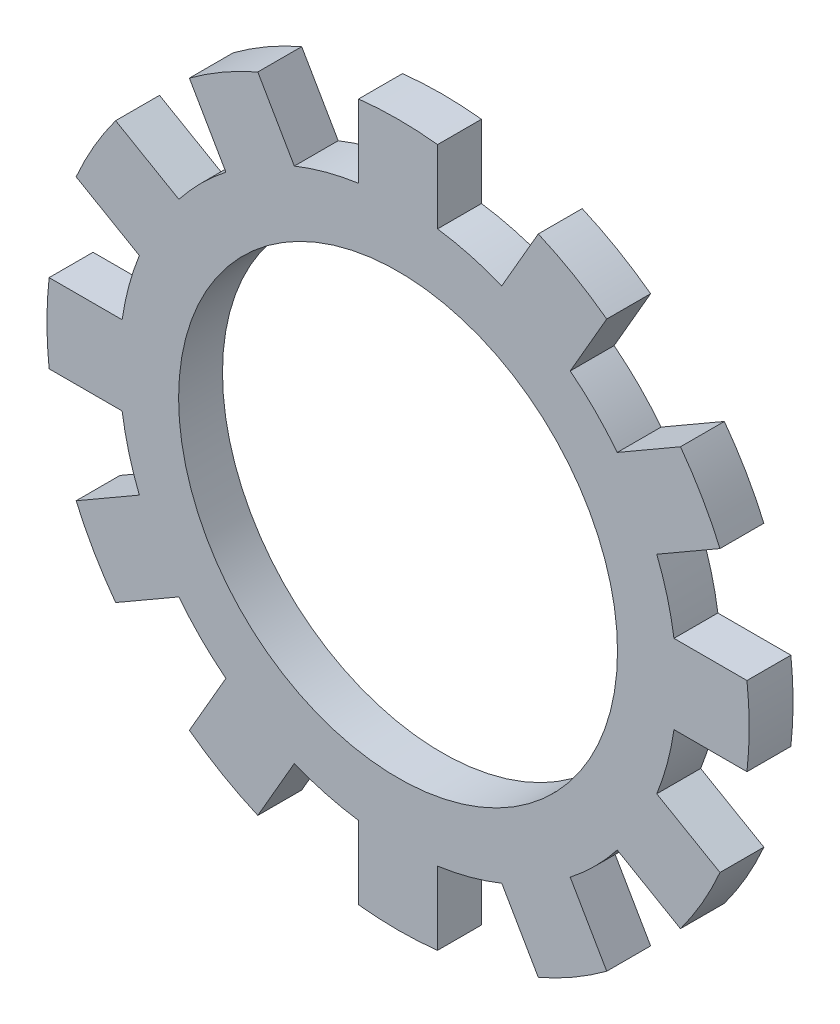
ISO-10303-21;
HEADER;
FILE_DESCRIPTION(('STEP AP214'),'2;1');
FILE_NAME('part.step','',(''),(''),'','','');
FILE_SCHEMA(('AUTOMOTIVE_DESIGN { 1 0 10303 214 1 1 1 1 }'));
ENDSEC;
DATA;
#1=APPLICATION_CONTEXT('core data for automotive mechanical design processes');
#2=APPLICATION_PROTOCOL_DEFINITION('international standard','automotive_design',2000,#1);
#3=PRODUCT_CONTEXT('',#1,'mechanical');
#4=PRODUCT('Part','Part','',(#3));
#5=PRODUCT_RELATED_PRODUCT_CATEGORY('part','',(#4));
#6=PRODUCT_DEFINITION_FORMATION('','',#4);
#7=PRODUCT_DEFINITION_CONTEXT('part definition',#1,'design');
#8=PRODUCT_DEFINITION('design','',#6,#7);
#9=PRODUCT_DEFINITION_SHAPE('','',#8);
#10=(LENGTH_UNIT() NAMED_UNIT(*) SI_UNIT(.MILLI.,.METRE.));
#11=(NAMED_UNIT(*) PLANE_ANGLE_UNIT() SI_UNIT($,.RADIAN.));
#12=(NAMED_UNIT(*) SI_UNIT($,.STERADIAN.) SOLID_ANGLE_UNIT());
#13=UNCERTAINTY_MEASURE_WITH_UNIT(LENGTH_MEASURE(1.E-05),#10,'distance_accuracy_value','');
#14=(GEOMETRIC_REPRESENTATION_CONTEXT(3) GLOBAL_UNCERTAINTY_ASSIGNED_CONTEXT((#13)) GLOBAL_UNIT_ASSIGNED_CONTEXT((#10,
#11,#12)) REPRESENTATION_CONTEXT('',''));
#15=CARTESIAN_POINT('',(0.,0.,0.));
#16=DIRECTION('',(0.,0.,1.));
#17=DIRECTION('',(1.,0.,0.));
#18=AXIS2_PLACEMENT_3D('',#15,#16,#17);
#19=CARTESIAN_POINT('',(0.,0.,0.25));
#20=DIRECTION('',(0.,0.,-1.));
#21=DIRECTION('',(-1.,0.,0.));
#22=AXIS2_PLACEMENT_3D('',#19,#20,#21);
#23=CYLINDRICAL_SURFACE('',#22,3.175);
#24=CARTESIAN_POINT('',(0.,0.,-0.25));
#25=DIRECTION('',(0.,0.,1.));
#26=DIRECTION('',(1.,0.,0.));
#27=AXIS2_PLACEMENT_3D('',#24,#25,#26);
#28=CIRCLE('',#27,3.175);
#29=CARTESIAN_POINT('',(2.49687320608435,1.96118565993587,-0.25));
#30=VERTEX_POINT('',#29);
#31=CARTESIAN_POINT('',(1.96118565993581,2.49687320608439,-0.25));
#32=VERTEX_POINT('',#31);
#33=EDGE_CURVE('E361',#30,#32,#28,.T.);
#34=ORIENTED_EDGE('',*,*,#33,.T.);
#35=DIRECTION('',(0.,0.,-1.));
#36=VECTOR('',#35,1.);
#37=CARTESIAN_POINT('',(1.96118565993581,2.49687320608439,0.25));
#38=LINE('',#37,#36);
#39=CARTESIAN_POINT('',(1.96118565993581,2.49687320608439,0.25));
#40=VERTEX_POINT('',#39);
#41=EDGE_CURVE('E352',#40,#32,#38,.T.);
#42=ORIENTED_EDGE('',*,*,#41,.F.);
#43=CARTESIAN_POINT('',(0.,0.,0.25));
#44=DIRECTION('',(0.,0.,1.));
#45=DIRECTION('',(1.,0.,0.));
#46=AXIS2_PLACEMENT_3D('',#43,#44,#45);
#47=CIRCLE('',#46,3.175);
#48=CARTESIAN_POINT('',(2.49687320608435,1.96118565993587,0.25));
#49=VERTEX_POINT('',#48);
#50=EDGE_CURVE('E64',#49,#40,#47,.T.);
#51=ORIENTED_EDGE('',*,*,#50,.F.);
#52=DIRECTION('',(0.,0.,-1.));
#53=VECTOR('',#52,1.);
#54=CARTESIAN_POINT('',(2.49687320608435,1.96118565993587,0.25));
#55=LINE('',#54,#53);
#56=EDGE_CURVE('E628',#49,#30,#55,.T.);
#57=ORIENTED_EDGE('',*,*,#56,.T.);
#58=EDGE_LOOP('',(#34,#42,#51,#57));
#59=FACE_BOUND('',#58,.T.);
#60=ADVANCED_FACE('F39',(#59),#23,.T.);
#61=DIRECTION('',(0.,0.,-1.));
#62=VECTOR('',#61,1.);
#63=CARTESIAN_POINT('',(1.1817627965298,2.94687320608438,0.25));
#64=LINE('',#63,#62);
#65=CARTESIAN_POINT('',(1.1817627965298,2.94687320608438,0.25));
#66=VERTEX_POINT('',#65);
#67=CARTESIAN_POINT('',(1.1817627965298,2.94687320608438,-0.25));
#68=VERTEX_POINT('',#67);
#69=EDGE_CURVE('E647',#66,#68,#64,.T.);
#70=ORIENTED_EDGE('',*,*,#69,.T.);
#71=CARTESIAN_POINT('',(0.45,3.14294845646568,-0.25));
#72=VERTEX_POINT('',#71);
#73=EDGE_CURVE('E388',#68,#72,#28,.T.);
#74=ORIENTED_EDGE('',*,*,#73,.T.);
#75=DIRECTION('',(0.,0.,-1.));
#76=VECTOR('',#75,1.);
#77=CARTESIAN_POINT('',(0.45,3.14294845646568,0.25));
#78=LINE('',#77,#76);
#79=CARTESIAN_POINT('',(0.45,3.14294845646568,0.25));
#80=VERTEX_POINT('',#79);
#81=EDGE_CURVE('E405',#80,#72,#78,.T.);
#82=ORIENTED_EDGE('',*,*,#81,.F.);
#83=EDGE_CURVE('E50',#66,#80,#47,.T.);
#84=ORIENTED_EDGE('',*,*,#83,.F.);
#85=EDGE_LOOP('',(#70,#74,#82,#84));
#86=FACE_BOUND('',#85,.T.);
#87=ADVANCED_FACE('F817',(#86),#23,.T.);
#88=CARTESIAN_POINT('',(3.14294845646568,0.450000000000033,-0.25));
#89=VERTEX_POINT('',#88);
#90=CARTESIAN_POINT('',(2.94687320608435,1.18176279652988,-0.25));
#91=VERTEX_POINT('',#90);
#92=EDGE_CURVE('E906',#89,#91,#28,.T.);
#93=ORIENTED_EDGE('',*,*,#92,.T.);
#94=DIRECTION('',(0.,0.,-1.));
#95=VECTOR('',#94,1.);
#96=CARTESIAN_POINT('',(2.94687320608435,1.18176279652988,0.25));
#97=LINE('',#96,#95);
#98=CARTESIAN_POINT('',(2.94687320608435,1.18176279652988,0.25));
#99=VERTEX_POINT('',#98);
#100=EDGE_CURVE('E787',#99,#91,#97,.T.);
#101=ORIENTED_EDGE('',*,*,#100,.F.);
#102=CARTESIAN_POINT('',(3.14294845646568,0.450000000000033,0.25));
#103=VERTEX_POINT('',#102);
#104=EDGE_CURVE('E371',#103,#99,#47,.T.);
#105=ORIENTED_EDGE('',*,*,#104,.F.);
#106=DIRECTION('',(0.,0.,-1.));
#107=VECTOR('',#106,1.);
#108=CARTESIAN_POINT('',(3.14294845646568,0.450000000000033,0.25));
#109=LINE('',#108,#107);
#110=EDGE_CURVE('E606',#103,#89,#109,.T.);
#111=ORIENTED_EDGE('',*,*,#110,.T.);
#112=EDGE_LOOP('',(#93,#101,#105,#111));
#113=FACE_BOUND('',#112,.T.);
#114=ADVANCED_FACE('F904',(#113),#23,.T.);
#115=CARTESIAN_POINT('',(2.94687320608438,-1.18176279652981,-0.25));
#116=VERTEX_POINT('',#115);
#117=CARTESIAN_POINT('',(3.14294845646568,-0.449999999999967,-0.25));
#118=VERTEX_POINT('',#117);
#119=EDGE_CURVE('E887',#116,#118,#28,.T.);
#120=ORIENTED_EDGE('',*,*,#119,.T.);
#121=DIRECTION('',(0.,0.,-1.));
#122=VECTOR('',#121,1.);
#123=CARTESIAN_POINT('',(3.14294845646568,-0.449999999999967,0.25));
#124=LINE('',#123,#122);
#125=CARTESIAN_POINT('',(3.14294845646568,-0.449999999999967,0.25));
#126=VERTEX_POINT('',#125);
#127=EDGE_CURVE('E773',#126,#118,#124,.T.);
#128=ORIENTED_EDGE('',*,*,#127,.F.);
#129=CARTESIAN_POINT('',(2.94687320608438,-1.18176279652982,0.25));
#130=VERTEX_POINT('',#129);
#131=EDGE_CURVE('E376',#130,#126,#47,.T.);
#132=ORIENTED_EDGE('',*,*,#131,.F.);
#133=DIRECTION('',(0.,0.,-1.));
#134=VECTOR('',#133,1.);
#135=CARTESIAN_POINT('',(2.94687320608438,-1.18176279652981,0.25));
#136=LINE('',#135,#134);
#137=EDGE_CURVE('E584',#130,#116,#136,.T.);
#138=ORIENTED_EDGE('',*,*,#137,.T.);
#139=EDGE_LOOP('',(#120,#128,#132,#138));
#140=FACE_BOUND('',#139,.T.);
#141=ADVANCED_FACE('F886',(#140),#23,.T.);
#142=CARTESIAN_POINT('',(1.96118565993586,-2.49687320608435,-0.25));
#143=VERTEX_POINT('',#142);
#144=CARTESIAN_POINT('',(2.49687320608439,-1.96118565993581,-0.25));
#145=VERTEX_POINT('',#144);
#146=EDGE_CURVE('E967',#143,#145,#28,.T.);
#147=ORIENTED_EDGE('',*,*,#146,.T.);
#148=DIRECTION('',(0.,0.,-1.));
#149=VECTOR('',#148,1.);
#150=CARTESIAN_POINT('',(2.49687320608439,-1.96118565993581,0.25));
#151=LINE('',#150,#149);
#152=CARTESIAN_POINT('',(2.49687320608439,-1.96118565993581,0.25));
#153=VERTEX_POINT('',#152);
#154=EDGE_CURVE('E759',#153,#145,#151,.T.);
#155=ORIENTED_EDGE('',*,*,#154,.F.);
#156=CARTESIAN_POINT('',(1.96118565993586,-2.49687320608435,0.25));
#157=VERTEX_POINT('',#156);
#158=EDGE_CURVE('E873',#157,#153,#47,.T.);
#159=ORIENTED_EDGE('',*,*,#158,.F.);
#160=DIRECTION('',(0.,0.,-1.));
#161=VECTOR('',#160,1.);
#162=CARTESIAN_POINT('',(1.96118565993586,-2.49687320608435,0.25));
#163=LINE('',#162,#161);
#164=EDGE_CURVE('E562',#157,#143,#163,.T.);
#165=ORIENTED_EDGE('',*,*,#164,.T.);
#166=EDGE_LOOP('',(#147,#155,#159,#165));
#167=FACE_BOUND('',#166,.T.);
#168=ADVANCED_FACE('F974',(#167),#23,.T.);
#169=CARTESIAN_POINT('',(0.45,-3.14294845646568,-0.25));
#170=VERTEX_POINT('',#169);
#171=CARTESIAN_POINT('',(1.18176279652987,-2.94687320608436,-0.25));
#172=VERTEX_POINT('',#171);
#173=EDGE_CURVE('E962',#170,#172,#28,.T.);
#174=ORIENTED_EDGE('',*,*,#173,.T.);
#175=DIRECTION('',(0.,0.,-1.));
#176=VECTOR('',#175,1.);
#177=CARTESIAN_POINT('',(1.18176279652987,-2.94687320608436,0.25));
#178=LINE('',#177,#176);
#179=CARTESIAN_POINT('',(1.18176279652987,-2.94687320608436,0.25));
#180=VERTEX_POINT('',#179);
#181=EDGE_CURVE('E745',#180,#172,#178,.T.);
#182=ORIENTED_EDGE('',*,*,#181,.F.);
#183=CARTESIAN_POINT('',(0.45,-3.14294845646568,0.25));
#184=VERTEX_POINT('',#183);
#185=EDGE_CURVE('E869',#184,#180,#47,.T.);
#186=ORIENTED_EDGE('',*,*,#185,.F.);
#187=DIRECTION('',(0.,0.,-1.));
#188=VECTOR('',#187,1.);
#189=CARTESIAN_POINT('',(0.45,-3.14294845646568,0.25));
#190=LINE('',#189,#188);
#191=EDGE_CURVE('E540',#184,#170,#190,.T.);
#192=ORIENTED_EDGE('',*,*,#191,.T.);
#193=EDGE_LOOP('',(#174,#182,#186,#192));
#194=FACE_BOUND('',#193,.T.);
#195=ADVANCED_FACE('F1402',(#194),#23,.T.);
#196=CARTESIAN_POINT('',(-1.18176279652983,-2.94687320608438,-0.25));
#197=VERTEX_POINT('',#196);
#198=CARTESIAN_POINT('',(-0.45,-3.14294845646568,-0.25));
#199=VERTEX_POINT('',#198);
#200=EDGE_CURVE('E956',#197,#199,#28,.T.);
#201=ORIENTED_EDGE('',*,*,#200,.T.);
#202=DIRECTION('',(0.,0.,-1.));
#203=VECTOR('',#202,1.);
#204=CARTESIAN_POINT('',(-0.45,-3.14294845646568,0.25));
#205=LINE('',#204,#203);
#206=CARTESIAN_POINT('',(-0.45,-3.14294845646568,0.25));
#207=VERTEX_POINT('',#206);
#208=EDGE_CURVE('E731',#207,#199,#205,.T.);
#209=ORIENTED_EDGE('',*,*,#208,.F.);
#210=CARTESIAN_POINT('',(-1.18176279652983,-2.94687320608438,0.25));
#211=VERTEX_POINT('',#210);
#212=EDGE_CURVE('E865',#211,#207,#47,.T.);
#213=ORIENTED_EDGE('',*,*,#212,.F.);
#214=DIRECTION('',(0.,0.,-1.));
#215=VECTOR('',#214,1.);
#216=CARTESIAN_POINT('',(-1.18176279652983,-2.94687320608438,0.25));
#217=LINE('',#216,#215);
#218=EDGE_CURVE('E518',#211,#197,#217,.T.);
#219=ORIENTED_EDGE('',*,*,#218,.T.);
#220=EDGE_LOOP('',(#201,#209,#213,#219));
#221=FACE_BOUND('',#220,.T.);
#222=ADVANCED_FACE('F1394',(#221),#23,.T.);
#223=CARTESIAN_POINT('',(-2.49687320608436,-1.96118565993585,-0.25));
#224=VERTEX_POINT('',#223);
#225=CARTESIAN_POINT('',(-1.96118565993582,-2.49687320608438,-0.25));
#226=VERTEX_POINT('',#225);
#227=EDGE_CURVE('E951',#224,#226,#28,.T.);
#228=ORIENTED_EDGE('',*,*,#227,.T.);
#229=DIRECTION('',(0.,0.,-1.));
#230=VECTOR('',#229,1.);
#231=CARTESIAN_POINT('',(-1.96118565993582,-2.49687320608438,0.25));
#232=LINE('',#231,#230);
#233=CARTESIAN_POINT('',(-1.96118565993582,-2.49687320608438,0.25));
#234=VERTEX_POINT('',#233);
#235=EDGE_CURVE('E717',#234,#226,#232,.T.);
#236=ORIENTED_EDGE('',*,*,#235,.F.);
#237=CARTESIAN_POINT('',(-2.49687320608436,-1.96118565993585,0.25));
#238=VERTEX_POINT('',#237);
#239=EDGE_CURVE('E860',#238,#234,#47,.T.);
#240=ORIENTED_EDGE('',*,*,#239,.F.);
#241=DIRECTION('',(0.,0.,-1.));
#242=VECTOR('',#241,1.);
#243=CARTESIAN_POINT('',(-2.49687320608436,-1.96118565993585,0.25));
#244=LINE('',#243,#242);
#245=EDGE_CURVE('E496',#238,#224,#244,.T.);
#246=ORIENTED_EDGE('',*,*,#245,.T.);
#247=EDGE_LOOP('',(#228,#236,#240,#246));
#248=FACE_BOUND('',#247,.T.);
#249=ADVANCED_FACE('F1386',(#248),#23,.T.);
#250=CARTESIAN_POINT('',(-3.14294845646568,-0.450000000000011,-0.25));
#251=VERTEX_POINT('',#250);
#252=CARTESIAN_POINT('',(-2.94687320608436,-1.18176279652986,-0.25));
#253=VERTEX_POINT('',#252);
#254=EDGE_CURVE('E948',#251,#253,#28,.T.);
#255=ORIENTED_EDGE('',*,*,#254,.T.);
#256=DIRECTION('',(0.,0.,-1.));
#257=VECTOR('',#256,1.);
#258=CARTESIAN_POINT('',(-2.94687320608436,-1.18176279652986,0.25));
#259=LINE('',#258,#257);
#260=CARTESIAN_POINT('',(-2.94687320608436,-1.18176279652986,0.25));
#261=VERTEX_POINT('',#260);
#262=EDGE_CURVE('E703',#261,#253,#259,.T.);
#263=ORIENTED_EDGE('',*,*,#262,.F.);
#264=CARTESIAN_POINT('',(-3.14294845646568,-0.450000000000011,0.25));
#265=VERTEX_POINT('',#264);
#266=EDGE_CURVE('E856',#265,#261,#47,.T.);
#267=ORIENTED_EDGE('',*,*,#266,.F.);
#268=DIRECTION('',(0.,0.,-1.));
#269=VECTOR('',#268,1.);
#270=CARTESIAN_POINT('',(-3.14294845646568,-0.450000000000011,0.25));
#271=LINE('',#270,#269);
#272=EDGE_CURVE('E474',#265,#251,#271,.T.);
#273=ORIENTED_EDGE('',*,*,#272,.T.);
#274=EDGE_LOOP('',(#255,#263,#267,#273));
#275=FACE_BOUND('',#274,.T.);
#276=ADVANCED_FACE('F939',(#275),#23,.T.);
#277=CARTESIAN_POINT('',(-2.94687320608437,1.18176279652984,-0.25));
#278=VERTEX_POINT('',#277);
#279=CARTESIAN_POINT('',(-3.14294845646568,0.449999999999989,-0.25));
#280=VERTEX_POINT('',#279);
#281=EDGE_CURVE('E944',#278,#280,#28,.T.);
#282=ORIENTED_EDGE('',*,*,#281,.T.);
#283=DIRECTION('',(0.,0.,-1.));
#284=VECTOR('',#283,1.);
#285=CARTESIAN_POINT('',(-3.14294845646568,0.449999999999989,0.25));
#286=LINE('',#285,#284);
#287=CARTESIAN_POINT('',(-3.14294845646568,0.449999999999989,0.25));
#288=VERTEX_POINT('',#287);
#289=EDGE_CURVE('E689',#288,#280,#286,.T.);
#290=ORIENTED_EDGE('',*,*,#289,.F.);
#291=CARTESIAN_POINT('',(-2.94687320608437,1.18176279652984,0.25));
#292=VERTEX_POINT('',#291);
#293=EDGE_CURVE('E852',#292,#288,#47,.T.);
#294=ORIENTED_EDGE('',*,*,#293,.F.);
#295=DIRECTION('',(0.,0.,-1.));
#296=VECTOR('',#295,1.);
#297=CARTESIAN_POINT('',(-2.94687320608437,1.18176279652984,0.25));
#298=LINE('',#297,#296);
#299=EDGE_CURVE('E452',#292,#278,#298,.T.);
#300=ORIENTED_EDGE('',*,*,#299,.T.);
#301=EDGE_LOOP('',(#282,#290,#294,#300));
#302=FACE_BOUND('',#301,.T.);
#303=ADVANCED_FACE('F935',(#302),#23,.T.);
#304=CARTESIAN_POINT('',(-1.96118565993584,2.49687320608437,-0.25));
#305=VERTEX_POINT('',#304);
#306=CARTESIAN_POINT('',(-2.49687320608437,1.96118565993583,-0.25));
#307=VERTEX_POINT('',#306);
#308=EDGE_CURVE('E942',#305,#307,#28,.T.);
#309=ORIENTED_EDGE('',*,*,#308,.T.);
#310=DIRECTION('',(0.,0.,-1.));
#311=VECTOR('',#310,1.);
#312=CARTESIAN_POINT('',(-2.49687320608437,1.96118565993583,0.25));
#313=LINE('',#312,#311);
#314=CARTESIAN_POINT('',(-2.49687320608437,1.96118565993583,0.25));
#315=VERTEX_POINT('',#314);
#316=EDGE_CURVE('E675',#315,#307,#313,.T.);
#317=ORIENTED_EDGE('',*,*,#316,.F.);
#318=CARTESIAN_POINT('',(-1.96118565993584,2.49687320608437,0.25));
#319=VERTEX_POINT('',#318);
#320=EDGE_CURVE('E49',#319,#315,#47,.T.);
#321=ORIENTED_EDGE('',*,*,#320,.F.);
#322=DIRECTION('',(0.,0.,-1.));
#323=VECTOR('',#322,1.);
#324=CARTESIAN_POINT('',(-1.96118565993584,2.49687320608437,0.25));
#325=LINE('',#324,#323);
#326=EDGE_CURVE('E430',#319,#305,#325,.T.);
#327=ORIENTED_EDGE('',*,*,#326,.T.);
#328=EDGE_LOOP('',(#309,#317,#321,#327));
#329=FACE_BOUND('',#328,.T.);
#330=ADVANCED_FACE('F929',(#329),#23,.T.);
#331=CARTESIAN_POINT('',(-0.45,3.14294845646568,-0.25));
#332=VERTEX_POINT('',#331);
#333=CARTESIAN_POINT('',(-1.18176279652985,2.94687320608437,-0.25));
#334=VERTEX_POINT('',#333);
#335=EDGE_CURVE('E43',#332,#334,#28,.T.);
#336=ORIENTED_EDGE('',*,*,#335,.T.);
#337=DIRECTION('',(0.,0.,-1.));
#338=VECTOR('',#337,1.);
#339=CARTESIAN_POINT('',(-1.18176279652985,2.94687320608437,0.25));
#340=LINE('',#339,#338);
#341=CARTESIAN_POINT('',(-1.18176279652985,2.94687320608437,0.25));
#342=VERTEX_POINT('',#341);
#343=EDGE_CURVE('E659',#342,#334,#340,.T.);
#344=ORIENTED_EDGE('',*,*,#343,.F.);
#345=CARTESIAN_POINT('',(-0.45,3.14294845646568,0.25));
#346=VERTEX_POINT('',#345);
#347=EDGE_CURVE('E11',#346,#342,#47,.T.);
#348=ORIENTED_EDGE('',*,*,#347,.F.);
#349=DIRECTION('',(0.,0.,-1.));
#350=VECTOR('',#349,1.);
#351=CARTESIAN_POINT('',(-0.45,3.14294845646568,0.25));
#352=LINE('',#351,#350);
#353=EDGE_CURVE('E392',#346,#332,#352,.T.);
#354=ORIENTED_EDGE('',*,*,#353,.T.);
#355=EDGE_LOOP('',(#336,#344,#348,#354));
#356=FACE_BOUND('',#355,.T.);
#357=ADVANCED_FACE('F41',(#356),#23,.T.);
#358=CARTESIAN_POINT('',(0.,0.,0.25));
#359=DIRECTION('',(0.,0.,1.));
#360=DIRECTION('',(1.,0.,0.));
#361=AXIS2_PLACEMENT_3D('',#358,#359,#360);
#362=PLANE('',#361);
#363=ORIENTED_EDGE('',*,*,#347,.T.);
#364=DIRECTION('',(0.500000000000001,-0.866025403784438,0.));
#365=VECTOR('',#364,1.);
#366=CARTESIAN_POINT('',(-1.59759201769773,3.66711054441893,0.25));
#367=LINE('',#366,#365);
#368=CARTESIAN_POINT('',(-1.59759201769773,3.66711054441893,0.25));
#369=VERTEX_POINT('',#368);
#370=EDGE_CURVE('E670',#369,#342,#367,.T.);
#371=ORIENTED_EDGE('',*,*,#370,.F.);
#372=CARTESIAN_POINT('',(0.,0.,0.25));
#373=DIRECTION('',(0.,0.,1.));
#374=DIRECTION('',(0.866025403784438,0.500000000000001,0.));
#375=AXIS2_PLACEMENT_3D('',#372,#373,#374);
#376=CIRCLE('',#375,4.);
#377=CARTESIAN_POINT('',(-2.37701488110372,3.21711054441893,0.25));
#378=VERTEX_POINT('',#377);
#379=EDGE_CURVE('E439',#369,#378,#376,.T.);
#380=ORIENTED_EDGE('',*,*,#379,.T.);
#381=DIRECTION('',(0.500000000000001,-0.866025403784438,0.));
#382=VECTOR('',#381,1.);
#383=CARTESIAN_POINT('',(-2.37701488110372,3.21711054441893,0.25));
#384=LINE('',#383,#382);
#385=EDGE_CURVE('E434',#378,#319,#384,.T.);
#386=ORIENTED_EDGE('',*,*,#385,.T.);
#387=ORIENTED_EDGE('',*,*,#320,.T.);
#388=DIRECTION('',(0.86602540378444,-0.499999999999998,0.));
#389=VECTOR('',#388,1.);
#390=CARTESIAN_POINT('',(-3.21711054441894,2.37701488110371,0.25));
#391=LINE('',#390,#389);
#392=CARTESIAN_POINT('',(-3.21711054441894,2.37701488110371,0.25));
#393=VERTEX_POINT('',#392);
#394=EDGE_CURVE('E684',#393,#315,#391,.T.);
#395=ORIENTED_EDGE('',*,*,#394,.F.);
#396=CARTESIAN_POINT('',(0.,0.,0.25));
#397=DIRECTION('',(0.,0.,1.));
#398=DIRECTION('',(0.499999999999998,0.86602540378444,0.));
#399=AXIS2_PLACEMENT_3D('',#396,#397,#398);
#400=CIRCLE('',#399,4.);
#401=CARTESIAN_POINT('',(-3.66711054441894,1.59759201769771,0.25));
#402=VERTEX_POINT('',#401);
#403=EDGE_CURVE('E461',#393,#402,#400,.T.);
#404=ORIENTED_EDGE('',*,*,#403,.T.);
#405=DIRECTION('',(0.86602540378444,-0.499999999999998,0.));
#406=VECTOR('',#405,1.);
#407=CARTESIAN_POINT('',(-3.66711054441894,1.59759201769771,0.25));
#408=LINE('',#407,#406);
#409=EDGE_CURVE('E456',#402,#292,#408,.T.);
#410=ORIENTED_EDGE('',*,*,#409,.T.);
#411=ORIENTED_EDGE('',*,*,#293,.T.);
#412=DIRECTION('',(1.,0.,0.));
#413=VECTOR('',#412,1.);
#414=CARTESIAN_POINT('',(-3.97460689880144,0.449999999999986,0.25));
#415=LINE('',#414,#413);
#416=CARTESIAN_POINT('',(-3.97460689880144,0.449999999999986,0.25));
#417=VERTEX_POINT('',#416);
#418=EDGE_CURVE('E698',#417,#288,#415,.T.);
#419=ORIENTED_EDGE('',*,*,#418,.F.);
#420=CARTESIAN_POINT('',(0.,0.,0.25));
#421=DIRECTION('',(0.,0.,1.));
#422=DIRECTION('',(0.,1.,0.));
#423=AXIS2_PLACEMENT_3D('',#420,#421,#422);
#424=CIRCLE('',#423,4.);
#425=CARTESIAN_POINT('',(-3.97460689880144,-0.450000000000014,0.25));
#426=VERTEX_POINT('',#425);
#427=EDGE_CURVE('E483',#417,#426,#424,.T.);
#428=ORIENTED_EDGE('',*,*,#427,.T.);
#429=DIRECTION('',(1.,0.,0.));
#430=VECTOR('',#429,1.);
#431=CARTESIAN_POINT('',(-3.97460689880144,-0.450000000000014,0.25));
#432=LINE('',#431,#430);
#433=EDGE_CURVE('E478',#426,#265,#432,.T.);
#434=ORIENTED_EDGE('',*,*,#433,.T.);
#435=ORIENTED_EDGE('',*,*,#266,.T.);
#436=DIRECTION('',(0.866025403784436,0.500000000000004,0.));
#437=VECTOR('',#436,1.);
#438=CARTESIAN_POINT('',(-3.66711054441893,-1.59759201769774,0.25));
#439=LINE('',#438,#437);
#440=CARTESIAN_POINT('',(-3.66711054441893,-1.59759201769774,0.25));
#441=VERTEX_POINT('',#440);
#442=EDGE_CURVE('E712',#441,#261,#439,.T.);
#443=ORIENTED_EDGE('',*,*,#442,.F.);
#444=CARTESIAN_POINT('',(0.,0.,0.25));
#445=DIRECTION('',(0.,0.,1.));
#446=DIRECTION('',(-0.500000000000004,0.866025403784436,0.));
#447=AXIS2_PLACEMENT_3D('',#444,#445,#446);
#448=CIRCLE('',#447,4.);
#449=CARTESIAN_POINT('',(-3.21711054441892,-2.37701488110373,0.25));
#450=VERTEX_POINT('',#449);
#451=EDGE_CURVE('E505',#441,#450,#448,.T.);
#452=ORIENTED_EDGE('',*,*,#451,.T.);
#453=DIRECTION('',(0.866025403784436,0.500000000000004,0.));
#454=VECTOR('',#453,1.);
#455=CARTESIAN_POINT('',(-3.21711054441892,-2.37701488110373,0.25));
#456=LINE('',#455,#454);
#457=EDGE_CURVE('E500',#450,#238,#456,.T.);
#458=ORIENTED_EDGE('',*,*,#457,.T.);
#459=ORIENTED_EDGE('',*,*,#239,.T.);
#460=DIRECTION('',(0.499999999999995,0.866025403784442,0.));
#461=VECTOR('',#460,1.);
#462=CARTESIAN_POINT('',(-2.3770148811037,-3.21711054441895,0.25));
#463=LINE('',#462,#461);
#464=CARTESIAN_POINT('',(-2.3770148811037,-3.21711054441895,0.25));
#465=VERTEX_POINT('',#464);
#466=EDGE_CURVE('E726',#465,#234,#463,.T.);
#467=ORIENTED_EDGE('',*,*,#466,.F.);
#468=CARTESIAN_POINT('',(0.,0.,0.25));
#469=DIRECTION('',(0.,0.,1.));
#470=DIRECTION('',(-0.866025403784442,0.499999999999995,0.));
#471=AXIS2_PLACEMENT_3D('',#468,#469,#470);
#472=CIRCLE('',#471,4.);
#473=CARTESIAN_POINT('',(-1.5975920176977,-3.66711054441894,0.25));
#474=VERTEX_POINT('',#473);
#475=EDGE_CURVE('E527',#465,#474,#472,.T.);
#476=ORIENTED_EDGE('',*,*,#475,.T.);
#477=DIRECTION('',(0.499999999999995,0.866025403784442,0.));
#478=VECTOR('',#477,1.);
#479=CARTESIAN_POINT('',(-1.5975920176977,-3.66711054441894,0.25));
#480=LINE('',#479,#478);
#481=EDGE_CURVE('E522',#474,#211,#480,.T.);
#482=ORIENTED_EDGE('',*,*,#481,.T.);
#483=ORIENTED_EDGE('',*,*,#212,.T.);
#484=DIRECTION('',(0.,1.,0.));
#485=VECTOR('',#484,1.);
#486=CARTESIAN_POINT('',(-0.45,-3.97460689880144,0.25));
#487=LINE('',#486,#485);
#488=CARTESIAN_POINT('',(-0.45,-3.97460689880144,0.25));
#489=VERTEX_POINT('',#488);
#490=EDGE_CURVE('E740',#489,#207,#487,.T.);
#491=ORIENTED_EDGE('',*,*,#490,.F.);
#492=CARTESIAN_POINT('',(0.,0.,0.25));
#493=DIRECTION('',(0.,0.,1.));
#494=DIRECTION('',(-1.,0.,0.));
#495=AXIS2_PLACEMENT_3D('',#492,#493,#494);
#496=CIRCLE('',#495,4.);
#497=CARTESIAN_POINT('',(0.45,-3.97460689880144,0.25));
#498=VERTEX_POINT('',#497);
#499=EDGE_CURVE('E549',#489,#498,#496,.T.);
#500=ORIENTED_EDGE('',*,*,#499,.T.);
#501=DIRECTION('',(0.,1.,0.));
#502=VECTOR('',#501,1.);
#503=CARTESIAN_POINT('',(0.45,-3.97460689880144,0.25));
#504=LINE('',#503,#502);
#505=EDGE_CURVE('E544',#498,#184,#504,.T.);
#506=ORIENTED_EDGE('',*,*,#505,.T.);
#507=ORIENTED_EDGE('',*,*,#185,.T.);
#508=DIRECTION('',(-0.500000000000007,0.866025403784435,0.));
#509=VECTOR('',#508,1.);
#510=CARTESIAN_POINT('',(1.59759201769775,-3.66711054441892,0.25));
#511=LINE('',#510,#509);
#512=CARTESIAN_POINT('',(1.59759201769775,-3.66711054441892,0.25));
#513=VERTEX_POINT('',#512);
#514=EDGE_CURVE('E754',#513,#180,#511,.T.);
#515=ORIENTED_EDGE('',*,*,#514,.F.);
#516=CARTESIAN_POINT('',(0.,0.,0.25));
#517=DIRECTION('',(0.,0.,1.));
#518=DIRECTION('',(-0.866025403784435,-0.500000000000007,0.));
#519=AXIS2_PLACEMENT_3D('',#516,#517,#518);
#520=CIRCLE('',#519,4.);
#521=CARTESIAN_POINT('',(2.37701488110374,-3.21711054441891,0.25));
#522=VERTEX_POINT('',#521);
#523=EDGE_CURVE('E571',#513,#522,#520,.T.);
#524=ORIENTED_EDGE('',*,*,#523,.T.);
#525=DIRECTION('',(-0.500000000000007,0.866025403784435,0.));
#526=VECTOR('',#525,1.);
#527=CARTESIAN_POINT('',(2.37701488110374,-3.21711054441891,0.25));
#528=LINE('',#527,#526);
#529=EDGE_CURVE('E566',#522,#157,#528,.T.);
#530=ORIENTED_EDGE('',*,*,#529,.T.);
#531=ORIENTED_EDGE('',*,*,#158,.T.);
#532=DIRECTION('',(-0.866025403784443,0.499999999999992,0.));
#533=VECTOR('',#532,1.);
#534=CARTESIAN_POINT('',(3.21711054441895,-2.37701488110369,0.25));
#535=LINE('',#534,#533);
#536=CARTESIAN_POINT('',(3.21711054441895,-2.37701488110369,0.25));
#537=VERTEX_POINT('',#536);
#538=EDGE_CURVE('E768',#537,#153,#535,.T.);
#539=ORIENTED_EDGE('',*,*,#538,.F.);
#540=CARTESIAN_POINT('',(0.,0.,0.25));
#541=DIRECTION('',(0.,0.,1.));
#542=DIRECTION('',(-0.499999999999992,-0.866025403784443,0.));
#543=AXIS2_PLACEMENT_3D('',#540,#541,#542);
#544=CIRCLE('',#543,4.);
#545=CARTESIAN_POINT('',(3.66711054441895,-1.59759201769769,0.25));
#546=VERTEX_POINT('',#545);
#547=EDGE_CURVE('E593',#537,#546,#544,.T.);
#548=ORIENTED_EDGE('',*,*,#547,.T.);
#549=DIRECTION('',(-0.866025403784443,0.499999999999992,0.));
#550=VECTOR('',#549,1.);
#551=CARTESIAN_POINT('',(3.66711054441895,-1.59759201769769,0.25));
#552=LINE('',#551,#550);
#553=EDGE_CURVE('E588',#546,#130,#552,.T.);
#554=ORIENTED_EDGE('',*,*,#553,.T.);
#555=ORIENTED_EDGE('',*,*,#131,.T.);
#556=DIRECTION('',(-1.,0.,0.));
#557=VECTOR('',#556,1.);
#558=CARTESIAN_POINT('',(3.97460689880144,-0.449999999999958,0.25));
#559=LINE('',#558,#557);
#560=CARTESIAN_POINT('',(3.97460689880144,-0.449999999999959,0.25));
#561=VERTEX_POINT('',#560);
#562=EDGE_CURVE('E782',#561,#126,#559,.T.);
#563=ORIENTED_EDGE('',*,*,#562,.F.);
#564=CARTESIAN_POINT('',(0.,0.,0.25));
#565=DIRECTION('',(0.,0.,1.));
#566=DIRECTION('',(0.,-1.,0.));
#567=AXIS2_PLACEMENT_3D('',#564,#565,#566);
#568=CIRCLE('',#567,4.);
#569=CARTESIAN_POINT('',(3.97460689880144,0.450000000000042,0.25));
#570=VERTEX_POINT('',#569);
#571=EDGE_CURVE('E615',#561,#570,#568,.T.);
#572=ORIENTED_EDGE('',*,*,#571,.T.);
#573=DIRECTION('',(-1.,0.,0.));
#574=VECTOR('',#573,1.);
#575=CARTESIAN_POINT('',(3.97460689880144,0.450000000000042,0.25));
#576=LINE('',#575,#574);
#577=EDGE_CURVE('E610',#570,#103,#576,.T.);
#578=ORIENTED_EDGE('',*,*,#577,.T.);
#579=ORIENTED_EDGE('',*,*,#104,.T.);
#580=DIRECTION('',(-0.866025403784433,-0.50000000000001,0.));
#581=VECTOR('',#580,1.);
#582=CARTESIAN_POINT('',(3.66711054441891,1.59759201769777,0.25));
#583=LINE('',#582,#581);
#584=CARTESIAN_POINT('',(3.66711054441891,1.59759201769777,0.25));
#585=VERTEX_POINT('',#584);
#586=EDGE_CURVE('E796',#585,#99,#583,.T.);
#587=ORIENTED_EDGE('',*,*,#586,.F.);
#588=CARTESIAN_POINT('',(0.,0.,0.25));
#589=DIRECTION('',(0.,0.,1.));
#590=DIRECTION('',(0.50000000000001,-0.866025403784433,0.));
#591=AXIS2_PLACEMENT_3D('',#588,#589,#590);
#592=CIRCLE('',#591,4.);
#593=CARTESIAN_POINT('',(3.2171105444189,2.37701488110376,0.25));
#594=VERTEX_POINT('',#593);
#595=EDGE_CURVE('E635',#585,#594,#592,.T.);
#596=ORIENTED_EDGE('',*,*,#595,.T.);
#597=DIRECTION('',(-0.866025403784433,-0.50000000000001,0.));
#598=VECTOR('',#597,1.);
#599=CARTESIAN_POINT('',(3.2171105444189,2.37701488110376,0.25));
#600=LINE('',#599,#598);
#601=EDGE_CURVE('E368',#594,#49,#600,.T.);
#602=ORIENTED_EDGE('',*,*,#601,.T.);
#603=ORIENTED_EDGE('',*,*,#50,.T.);
#604=DIRECTION('',(-0.499999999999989,-0.866025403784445,0.));
#605=VECTOR('',#604,1.);
#606=CARTESIAN_POINT('',(2.37701488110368,3.21711054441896,0.25));
#607=LINE('',#606,#605);
#608=CARTESIAN_POINT('',(2.37701488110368,3.21711054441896,0.25));
#609=VERTEX_POINT('',#608);
#610=EDGE_CURVE('E349',#609,#40,#607,.T.);
#611=ORIENTED_EDGE('',*,*,#610,.F.);
#612=CARTESIAN_POINT('',(0.,0.,0.25));
#613=DIRECTION('',(0.,0.,1.));
#614=DIRECTION('',(0.866025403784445,-0.499999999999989,0.));
#615=AXIS2_PLACEMENT_3D('',#612,#613,#614);
#616=CIRCLE('',#615,4.);
#617=CARTESIAN_POINT('',(1.59759201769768,3.66711054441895,0.25));
#618=VERTEX_POINT('',#617);
#619=EDGE_CURVE('E655',#609,#618,#616,.T.);
#620=ORIENTED_EDGE('',*,*,#619,.T.);
#621=DIRECTION('',(-0.499999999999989,-0.866025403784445,0.));
#622=VECTOR('',#621,1.);
#623=CARTESIAN_POINT('',(1.59759201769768,3.66711054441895,0.25));
#624=LINE('',#623,#622);
#625=EDGE_CURVE('E650',#618,#66,#624,.T.);
#626=ORIENTED_EDGE('',*,*,#625,.T.);
#627=ORIENTED_EDGE('',*,*,#83,.T.);
#628=DIRECTION('',(0.,-1.,0.));
#629=VECTOR('',#628,1.);
#630=CARTESIAN_POINT('',(0.45,3.97460689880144,0.25));
#631=LINE('',#630,#629);
#632=CARTESIAN_POINT('',(0.45,3.97460689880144,0.25));
#633=VERTEX_POINT('',#632);
#634=EDGE_CURVE('E418',#633,#80,#631,.T.);
#635=ORIENTED_EDGE('',*,*,#634,.F.);
#636=CARTESIAN_POINT('',(0.,0.,0.25));
#637=DIRECTION('',(0.,0.,1.));
#638=DIRECTION('',(1.,0.,0.));
#639=AXIS2_PLACEMENT_3D('',#636,#637,#638);
#640=CIRCLE('',#639,4.);
#641=CARTESIAN_POINT('',(-0.45,3.97460689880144,0.25));
#642=VERTEX_POINT('',#641);
#643=EDGE_CURVE('E401',#633,#642,#640,.T.);
#644=ORIENTED_EDGE('',*,*,#643,.T.);
#645=DIRECTION('',(0.,-1.,0.));
#646=VECTOR('',#645,1.);
#647=CARTESIAN_POINT('',(-0.45,3.97460689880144,0.25));
#648=LINE('',#647,#646);
#649=EDGE_CURVE('E396',#642,#346,#648,.T.);
#650=ORIENTED_EDGE('',*,*,#649,.T.);
#651=EDGE_LOOP('',(#363,#371,#380,#386,#387,#395,#404,#410,#411,#419,#428,#434,#435,#443,#452,
#458,#459,#467,#476,#482,#483,#491,#500,#506,#507,#515,#524,#530,#531,#539,#548,#554,#555,#563,
#572,#578,#579,#587,#596,#602,#603,#611,#620,#626,#627,#635,#644,#650));
#652=FACE_BOUND('',#651,.T.);
#653=CARTESIAN_POINT('',(0.,0.,0.25));
#654=DIRECTION('',(0.,0.,1.));
#655=DIRECTION('',(1.,0.,0.));
#656=AXIS2_PLACEMENT_3D('',#653,#654,#655);
#657=CIRCLE('',#656,2.5);
#658=CARTESIAN_POINT('',(2.5,0.,0.25));
#659=VERTEX_POINT('',#658);
#660=EDGE_CURVE('E383',#659,#659,#657,.T.);
#661=ORIENTED_EDGE('',*,*,#660,.F.);
#662=EDGE_LOOP('',(#661));
#663=FACE_BOUND('',#662,.T.);
#664=ADVANCED_FACE('F365',(#652,#663),#362,.T.);
#665=CARTESIAN_POINT('',(0.,0.,-0.25));
#666=DIRECTION('',(0.,0.,1.));
#667=DIRECTION('',(1.,0.,0.));
#668=AXIS2_PLACEMENT_3D('',#665,#666,#667);
#669=PLANE('',#668);
#670=ORIENTED_EDGE('',*,*,#335,.F.);
#671=DIRECTION('',(0.,-1.,0.));
#672=VECTOR('',#671,1.);
#673=CARTESIAN_POINT('',(-0.45,3.97460689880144,-0.25));
#674=LINE('',#673,#672);
#675=CARTESIAN_POINT('',(-0.45,3.97460689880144,-0.25));
#676=VERTEX_POINT('',#675);
#677=EDGE_CURVE('E397',#676,#332,#674,.T.);
#678=ORIENTED_EDGE('',*,*,#677,.F.);
#679=CARTESIAN_POINT('',(0.,0.,-0.25));
#680=DIRECTION('',(0.,0.,1.));
#681=DIRECTION('',(1.,0.,0.));
#682=AXIS2_PLACEMENT_3D('',#679,#680,#681);
#683=CIRCLE('',#682,4.);
#684=CARTESIAN_POINT('',(0.45,3.97460689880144,-0.25));
#685=VERTEX_POINT('',#684);
#686=EDGE_CURVE('E402',#685,#676,#683,.T.);
#687=ORIENTED_EDGE('',*,*,#686,.F.);
#688=DIRECTION('',(0.,-1.,0.));
#689=VECTOR('',#688,1.);
#690=CARTESIAN_POINT('',(0.45,3.97460689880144,-0.25));
#691=LINE('',#690,#689);
#692=EDGE_CURVE('E419',#685,#72,#691,.T.);
#693=ORIENTED_EDGE('',*,*,#692,.T.);
#694=ORIENTED_EDGE('',*,*,#73,.F.);
#695=DIRECTION('',(-0.499999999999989,-0.866025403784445,0.));
#696=VECTOR('',#695,1.);
#697=CARTESIAN_POINT('',(1.59759201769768,3.66711054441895,-0.25));
#698=LINE('',#697,#696);
#699=CARTESIAN_POINT('',(1.59759201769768,3.66711054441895,-0.25));
#700=VERTEX_POINT('',#699);
#701=EDGE_CURVE('E651',#700,#68,#698,.T.);
#702=ORIENTED_EDGE('',*,*,#701,.F.);
#703=CARTESIAN_POINT('',(0.,0.,-0.25));
#704=DIRECTION('',(0.,0.,1.));
#705=DIRECTION('',(0.866025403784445,-0.499999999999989,0.));
#706=AXIS2_PLACEMENT_3D('',#703,#704,#705);
#707=CIRCLE('',#706,4.);
#708=CARTESIAN_POINT('',(2.37701488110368,3.21711054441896,-0.25));
#709=VERTEX_POINT('',#708);
#710=EDGE_CURVE('E656',#709,#700,#707,.T.);
#711=ORIENTED_EDGE('',*,*,#710,.F.);
#712=DIRECTION('',(-0.499999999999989,-0.866025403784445,0.));
#713=VECTOR('',#712,1.);
#714=CARTESIAN_POINT('',(2.37701488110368,3.21711054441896,-0.25));
#715=LINE('',#714,#713);
#716=EDGE_CURVE('E358',#709,#32,#715,.T.);
#717=ORIENTED_EDGE('',*,*,#716,.T.);
#718=ORIENTED_EDGE('',*,*,#33,.F.);
#719=DIRECTION('',(-0.866025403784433,-0.50000000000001,0.));
#720=VECTOR('',#719,1.);
#721=CARTESIAN_POINT('',(3.2171105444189,2.37701488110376,-0.25));
#722=LINE('',#721,#720);
#723=CARTESIAN_POINT('',(3.2171105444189,2.37701488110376,-0.25));
#724=VERTEX_POINT('',#723);
#725=EDGE_CURVE('E631',#724,#30,#722,.T.);
#726=ORIENTED_EDGE('',*,*,#725,.F.);
#727=CARTESIAN_POINT('',(0.,0.,-0.25));
#728=DIRECTION('',(0.,0.,1.));
#729=DIRECTION('',(0.50000000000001,-0.866025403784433,0.));
#730=AXIS2_PLACEMENT_3D('',#727,#728,#729);
#731=CIRCLE('',#730,4.);
#732=CARTESIAN_POINT('',(3.66711054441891,1.59759201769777,-0.25));
#733=VERTEX_POINT('',#732);
#734=EDGE_CURVE('E636',#733,#724,#731,.T.);
#735=ORIENTED_EDGE('',*,*,#734,.F.);
#736=DIRECTION('',(-0.866025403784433,-0.50000000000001,0.));
#737=VECTOR('',#736,1.);
#738=CARTESIAN_POINT('',(3.66711054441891,1.59759201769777,-0.25));
#739=LINE('',#738,#737);
#740=EDGE_CURVE('E363',#733,#91,#739,.T.);
#741=ORIENTED_EDGE('',*,*,#740,.T.);
#742=ORIENTED_EDGE('',*,*,#92,.F.);
#743=DIRECTION('',(-1.,0.,0.));
#744=VECTOR('',#743,1.);
#745=CARTESIAN_POINT('',(3.97460689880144,0.450000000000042,-0.25));
#746=LINE('',#745,#744);
#747=CARTESIAN_POINT('',(3.97460689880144,0.450000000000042,-0.25));
#748=VERTEX_POINT('',#747);
#749=EDGE_CURVE('E611',#748,#89,#746,.T.);
#750=ORIENTED_EDGE('',*,*,#749,.F.);
#751=CARTESIAN_POINT('',(0.,0.,-0.25));
#752=DIRECTION('',(0.,0.,1.));
#753=DIRECTION('',(0.,-1.,0.));
#754=AXIS2_PLACEMENT_3D('',#751,#752,#753);
#755=CIRCLE('',#754,4.);
#756=CARTESIAN_POINT('',(3.97460689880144,-0.449999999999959,-0.25));
#757=VERTEX_POINT('',#756);
#758=EDGE_CURVE('E616',#757,#748,#755,.T.);
#759=ORIENTED_EDGE('',*,*,#758,.F.);
#760=DIRECTION('',(-1.,0.,0.));
#761=VECTOR('',#760,1.);
#762=CARTESIAN_POINT('',(3.97460689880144,-0.449999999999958,-0.25));
#763=LINE('',#762,#761);
#764=EDGE_CURVE('E783',#757,#118,#763,.T.);
#765=ORIENTED_EDGE('',*,*,#764,.T.);
#766=ORIENTED_EDGE('',*,*,#119,.F.);
#767=DIRECTION('',(-0.866025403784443,0.499999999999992,0.));
#768=VECTOR('',#767,1.);
#769=CARTESIAN_POINT('',(3.66711054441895,-1.59759201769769,-0.25));
#770=LINE('',#769,#768);
#771=CARTESIAN_POINT('',(3.66711054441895,-1.59759201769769,-0.25));
#772=VERTEX_POINT('',#771);
#773=EDGE_CURVE('E589',#772,#116,#770,.T.);
#774=ORIENTED_EDGE('',*,*,#773,.F.);
#775=CARTESIAN_POINT('',(0.,0.,-0.25));
#776=DIRECTION('',(0.,0.,1.));
#777=DIRECTION('',(-0.499999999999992,-0.866025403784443,0.));
#778=AXIS2_PLACEMENT_3D('',#775,#776,#777);
#779=CIRCLE('',#778,4.);
#780=CARTESIAN_POINT('',(3.21711054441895,-2.37701488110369,-0.25));
#781=VERTEX_POINT('',#780);
#782=EDGE_CURVE('E594',#781,#772,#779,.T.);
#783=ORIENTED_EDGE('',*,*,#782,.F.);
#784=DIRECTION('',(-0.866025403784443,0.499999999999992,0.));
#785=VECTOR('',#784,1.);
#786=CARTESIAN_POINT('',(3.21711054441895,-2.37701488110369,-0.25));
#787=LINE('',#786,#785);
#788=EDGE_CURVE('E769',#781,#145,#787,.T.);
#789=ORIENTED_EDGE('',*,*,#788,.T.);
#790=ORIENTED_EDGE('',*,*,#146,.F.);
#791=DIRECTION('',(-0.500000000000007,0.866025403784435,0.));
#792=VECTOR('',#791,1.);
#793=CARTESIAN_POINT('',(2.37701488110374,-3.21711054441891,-0.25));
#794=LINE('',#793,#792);
#795=CARTESIAN_POINT('',(2.37701488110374,-3.21711054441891,-0.25));
#796=VERTEX_POINT('',#795);
#797=EDGE_CURVE('E567',#796,#143,#794,.T.);
#798=ORIENTED_EDGE('',*,*,#797,.F.);
#799=CARTESIAN_POINT('',(0.,0.,-0.25));
#800=DIRECTION('',(0.,0.,1.));
#801=DIRECTION('',(-0.866025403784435,-0.500000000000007,0.));
#802=AXIS2_PLACEMENT_3D('',#799,#800,#801);
#803=CIRCLE('',#802,4.);
#804=CARTESIAN_POINT('',(1.59759201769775,-3.66711054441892,-0.25));
#805=VERTEX_POINT('',#804);
#806=EDGE_CURVE('E572',#805,#796,#803,.T.);
#807=ORIENTED_EDGE('',*,*,#806,.F.);
#808=DIRECTION('',(-0.500000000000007,0.866025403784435,0.));
#809=VECTOR('',#808,1.);
#810=CARTESIAN_POINT('',(1.59759201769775,-3.66711054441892,-0.25));
#811=LINE('',#810,#809);
#812=EDGE_CURVE('E755',#805,#172,#811,.T.);
#813=ORIENTED_EDGE('',*,*,#812,.T.);
#814=ORIENTED_EDGE('',*,*,#173,.F.);
#815=DIRECTION('',(0.,1.,0.));
#816=VECTOR('',#815,1.);
#817=CARTESIAN_POINT('',(0.45,-3.97460689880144,-0.25));
#818=LINE('',#817,#816);
#819=CARTESIAN_POINT('',(0.45,-3.97460689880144,-0.25));
#820=VERTEX_POINT('',#819);
#821=EDGE_CURVE('E545',#820,#170,#818,.T.);
#822=ORIENTED_EDGE('',*,*,#821,.F.);
#823=CARTESIAN_POINT('',(0.,0.,-0.25));
#824=DIRECTION('',(0.,0.,1.));
#825=DIRECTION('',(-1.,0.,0.));
#826=AXIS2_PLACEMENT_3D('',#823,#824,#825);
#827=CIRCLE('',#826,4.);
#828=CARTESIAN_POINT('',(-0.45,-3.97460689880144,-0.25));
#829=VERTEX_POINT('',#828);
#830=EDGE_CURVE('E550',#829,#820,#827,.T.);
#831=ORIENTED_EDGE('',*,*,#830,.F.);
#832=DIRECTION('',(0.,1.,0.));
#833=VECTOR('',#832,1.);
#834=CARTESIAN_POINT('',(-0.45,-3.97460689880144,-0.25));
#835=LINE('',#834,#833);
#836=EDGE_CURVE('E741',#829,#199,#835,.T.);
#837=ORIENTED_EDGE('',*,*,#836,.T.);
#838=ORIENTED_EDGE('',*,*,#200,.F.);
#839=DIRECTION('',(0.499999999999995,0.866025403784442,0.));
#840=VECTOR('',#839,1.);
#841=CARTESIAN_POINT('',(-1.5975920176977,-3.66711054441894,-0.25));
#842=LINE('',#841,#840);
#843=CARTESIAN_POINT('',(-1.5975920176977,-3.66711054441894,-0.25));
#844=VERTEX_POINT('',#843);
#845=EDGE_CURVE('E523',#844,#197,#842,.T.);
#846=ORIENTED_EDGE('',*,*,#845,.F.);
#847=CARTESIAN_POINT('',(0.,0.,-0.25));
#848=DIRECTION('',(0.,0.,1.));
#849=DIRECTION('',(-0.866025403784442,0.499999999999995,0.));
#850=AXIS2_PLACEMENT_3D('',#847,#848,#849);
#851=CIRCLE('',#850,4.);
#852=CARTESIAN_POINT('',(-2.3770148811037,-3.21711054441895,-0.25));
#853=VERTEX_POINT('',#852);
#854=EDGE_CURVE('E528',#853,#844,#851,.T.);
#855=ORIENTED_EDGE('',*,*,#854,.F.);
#856=DIRECTION('',(0.499999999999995,0.866025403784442,0.));
#857=VECTOR('',#856,1.);
#858=CARTESIAN_POINT('',(-2.3770148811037,-3.21711054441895,-0.25));
#859=LINE('',#858,#857);
#860=EDGE_CURVE('E727',#853,#226,#859,.T.);
#861=ORIENTED_EDGE('',*,*,#860,.T.);
#862=ORIENTED_EDGE('',*,*,#227,.F.);
#863=DIRECTION('',(0.866025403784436,0.500000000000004,0.));
#864=VECTOR('',#863,1.);
#865=CARTESIAN_POINT('',(-3.21711054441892,-2.37701488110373,-0.25));
#866=LINE('',#865,#864);
#867=CARTESIAN_POINT('',(-3.21711054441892,-2.37701488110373,-0.25));
#868=VERTEX_POINT('',#867);
#869=EDGE_CURVE('E501',#868,#224,#866,.T.);
#870=ORIENTED_EDGE('',*,*,#869,.F.);
#871=CARTESIAN_POINT('',(0.,0.,-0.25));
#872=DIRECTION('',(0.,0.,1.));
#873=DIRECTION('',(-0.500000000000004,0.866025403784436,0.));
#874=AXIS2_PLACEMENT_3D('',#871,#872,#873);
#875=CIRCLE('',#874,4.);
#876=CARTESIAN_POINT('',(-3.66711054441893,-1.59759201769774,-0.25));
#877=VERTEX_POINT('',#876);
#878=EDGE_CURVE('E506',#877,#868,#875,.T.);
#879=ORIENTED_EDGE('',*,*,#878,.F.);
#880=DIRECTION('',(0.866025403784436,0.500000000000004,0.));
#881=VECTOR('',#880,1.);
#882=CARTESIAN_POINT('',(-3.66711054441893,-1.59759201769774,-0.25));
#883=LINE('',#882,#881);
#884=EDGE_CURVE('E713',#877,#253,#883,.T.);
#885=ORIENTED_EDGE('',*,*,#884,.T.);
#886=ORIENTED_EDGE('',*,*,#254,.F.);
#887=DIRECTION('',(1.,0.,0.));
#888=VECTOR('',#887,1.);
#889=CARTESIAN_POINT('',(-3.97460689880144,-0.450000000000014,-0.25));
#890=LINE('',#889,#888);
#891=CARTESIAN_POINT('',(-3.97460689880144,-0.450000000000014,-0.25));
#892=VERTEX_POINT('',#891);
#893=EDGE_CURVE('E479',#892,#251,#890,.T.);
#894=ORIENTED_EDGE('',*,*,#893,.F.);
#895=CARTESIAN_POINT('',(0.,0.,-0.25));
#896=DIRECTION('',(0.,0.,1.));
#897=DIRECTION('',(0.,1.,0.));
#898=AXIS2_PLACEMENT_3D('',#895,#896,#897);
#899=CIRCLE('',#898,4.);
#900=CARTESIAN_POINT('',(-3.97460689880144,0.449999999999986,-0.25));
#901=VERTEX_POINT('',#900);
#902=EDGE_CURVE('E484',#901,#892,#899,.T.);
#903=ORIENTED_EDGE('',*,*,#902,.F.);
#904=DIRECTION('',(1.,0.,0.));
#905=VECTOR('',#904,1.);
#906=CARTESIAN_POINT('',(-3.97460689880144,0.449999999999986,-0.25));
#907=LINE('',#906,#905);
#908=EDGE_CURVE('E699',#901,#280,#907,.T.);
#909=ORIENTED_EDGE('',*,*,#908,.T.);
#910=ORIENTED_EDGE('',*,*,#281,.F.);
#911=DIRECTION('',(0.86602540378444,-0.499999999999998,0.));
#912=VECTOR('',#911,1.);
#913=CARTESIAN_POINT('',(-3.66711054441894,1.59759201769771,-0.25));
#914=LINE('',#913,#912);
#915=CARTESIAN_POINT('',(-3.66711054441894,1.59759201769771,-0.25));
#916=VERTEX_POINT('',#915);
#917=EDGE_CURVE('E457',#916,#278,#914,.T.);
#918=ORIENTED_EDGE('',*,*,#917,.F.);
#919=CARTESIAN_POINT('',(0.,0.,-0.25));
#920=DIRECTION('',(0.,0.,1.));
#921=DIRECTION('',(0.499999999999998,0.86602540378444,0.));
#922=AXIS2_PLACEMENT_3D('',#919,#920,#921);
#923=CIRCLE('',#922,4.);
#924=CARTESIAN_POINT('',(-3.21711054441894,2.37701488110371,-0.25));
#925=VERTEX_POINT('',#924);
#926=EDGE_CURVE('E462',#925,#916,#923,.T.);
#927=ORIENTED_EDGE('',*,*,#926,.F.);
#928=DIRECTION('',(0.86602540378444,-0.499999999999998,0.));
#929=VECTOR('',#928,1.);
#930=CARTESIAN_POINT('',(-3.21711054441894,2.37701488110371,-0.25));
#931=LINE('',#930,#929);
#932=EDGE_CURVE('E685',#925,#307,#931,.T.);
#933=ORIENTED_EDGE('',*,*,#932,.T.);
#934=ORIENTED_EDGE('',*,*,#308,.F.);
#935=DIRECTION('',(0.500000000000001,-0.866025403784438,0.));
#936=VECTOR('',#935,1.);
#937=CARTESIAN_POINT('',(-2.37701488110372,3.21711054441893,-0.25));
#938=LINE('',#937,#936);
#939=CARTESIAN_POINT('',(-2.37701488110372,3.21711054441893,-0.25));
#940=VERTEX_POINT('',#939);
#941=EDGE_CURVE('E435',#940,#305,#938,.T.);
#942=ORIENTED_EDGE('',*,*,#941,.F.);
#943=CARTESIAN_POINT('',(0.,0.,-0.25));
#944=DIRECTION('',(0.,0.,1.));
#945=DIRECTION('',(0.866025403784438,0.500000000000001,0.));
#946=AXIS2_PLACEMENT_3D('',#943,#944,#945);
#947=CIRCLE('',#946,4.);
#948=CARTESIAN_POINT('',(-1.59759201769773,3.66711054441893,-0.25));
#949=VERTEX_POINT('',#948);
#950=EDGE_CURVE('E440',#949,#940,#947,.T.);
#951=ORIENTED_EDGE('',*,*,#950,.F.);
#952=DIRECTION('',(0.500000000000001,-0.866025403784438,0.));
#953=VECTOR('',#952,1.);
#954=CARTESIAN_POINT('',(-1.59759201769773,3.66711054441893,-0.25));
#955=LINE('',#954,#953);
#956=EDGE_CURVE('E671',#949,#334,#955,.T.);
#957=ORIENTED_EDGE('',*,*,#956,.T.);
#958=EDGE_LOOP('',(#670,#678,#687,#693,#694,#702,#711,#717,#718,#726,#735,#741,#742,#750,#759,
#765,#766,#774,#783,#789,#790,#798,#807,#813,#814,#822,#831,#837,#838,#846,#855,#861,#862,#870,
#879,#885,#886,#894,#903,#909,#910,#918,#927,#933,#934,#942,#951,#957));
#959=FACE_BOUND('',#958,.T.);
#960=CARTESIAN_POINT('',(0.,0.,-0.25));
#961=DIRECTION('',(0.,0.,1.));
#962=DIRECTION('',(1.,0.,0.));
#963=AXIS2_PLACEMENT_3D('',#960,#961,#962);
#964=CIRCLE('',#963,2.5);
#965=CARTESIAN_POINT('',(2.5,0.,-0.25));
#966=VERTEX_POINT('',#965);
#967=EDGE_CURVE('E379',#966,#966,#964,.T.);
#968=ORIENTED_EDGE('',*,*,#967,.T.);
#969=EDGE_LOOP('',(#968));
#970=FACE_BOUND('',#969,.T.);
#971=ADVANCED_FACE('F805',(#959,#970),#669,.F.);
#972=CARTESIAN_POINT('',(0.,0.,0.25));
#973=DIRECTION('',(0.,0.,-1.));
#974=DIRECTION('',(-1.,0.,0.));
#975=AXIS2_PLACEMENT_3D('',#972,#973,#974);
#976=CYLINDRICAL_SURFACE('',#975,2.5);
#977=ORIENTED_EDGE('',*,*,#660,.T.);
#978=EDGE_LOOP('',(#977));
#979=FACE_BOUND('',#978,.T.);
#980=ORIENTED_EDGE('',*,*,#967,.F.);
#981=EDGE_LOOP('',(#980));
#982=FACE_BOUND('',#981,.T.);
#983=ADVANCED_FACE('F1054',(#979,#982),#976,.F.);
#984=CARTESIAN_POINT('',(0.,0.,0.25));
#985=DIRECTION('',(0.,0.,-1.));
#986=DIRECTION('',(-1.,0.,0.));
#987=AXIS2_PLACEMENT_3D('',#984,#985,#986);
#988=CYLINDRICAL_SURFACE('',#987,4.);
#989=ORIENTED_EDGE('',*,*,#686,.T.);
#990=DIRECTION('',(0.,0.,-1.));
#991=VECTOR('',#990,1.);
#992=CARTESIAN_POINT('',(-0.45,3.97460689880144,0.25));
#993=LINE('',#992,#991);
#994=EDGE_CURVE('E384',#642,#676,#993,.T.);
#995=ORIENTED_EDGE('',*,*,#994,.F.);
#996=ORIENTED_EDGE('',*,*,#643,.F.);
#997=DIRECTION('',(0.,0.,-1.));
#998=VECTOR('',#997,1.);
#999=CARTESIAN_POINT('',(0.45,3.97460689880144,0.25));
#1000=LINE('',#999,#998);
#1001=EDGE_CURVE('E414',#633,#685,#1000,.T.);
#1002=ORIENTED_EDGE('',*,*,#1001,.T.);
#1003=EDGE_LOOP('',(#989,#995,#996,#1002));
#1004=FACE_BOUND('',#1003,.T.);
#1005=ADVANCED_FACE('F826',(#1004),#988,.T.);
#1006=CARTESIAN_POINT('',(-0.45,3.97460689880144,0.25));
#1007=DIRECTION('',(1.,0.,0.));
#1008=DIRECTION('',(0.,1.,0.));
#1009=AXIS2_PLACEMENT_3D('',#1006,#1007,#1008);
#1010=PLANE('',#1009);
#1011=ORIENTED_EDGE('',*,*,#677,.T.);
#1012=ORIENTED_EDGE('',*,*,#353,.F.);
#1013=ORIENTED_EDGE('',*,*,#649,.F.);
#1014=ORIENTED_EDGE('',*,*,#994,.T.);
#1015=EDGE_LOOP('',(#1011,#1012,#1013,#1014));
#1016=FACE_BOUND('',#1015,.T.);
#1017=ADVANCED_FACE('F830',(#1016),#1010,.F.);
#1018=CARTESIAN_POINT('',(0.45,3.97460689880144,0.25));
#1019=DIRECTION('',(1.,0.,0.));
#1020=DIRECTION('',(0.,1.,0.));
#1021=AXIS2_PLACEMENT_3D('',#1018,#1019,#1020);
#1022=PLANE('',#1021);
#1023=ORIENTED_EDGE('',*,*,#692,.F.);
#1024=ORIENTED_EDGE('',*,*,#1001,.F.);
#1025=ORIENTED_EDGE('',*,*,#634,.T.);
#1026=ORIENTED_EDGE('',*,*,#81,.T.);
#1027=EDGE_LOOP('',(#1023,#1024,#1025,#1026));
#1028=FACE_BOUND('',#1027,.T.);
#1029=ADVANCED_FACE('F821',(#1028),#1022,.T.);
#1030=CARTESIAN_POINT('',(0.,0.,0.25));
#1031=DIRECTION('',(0.,0.,-1.));
#1032=DIRECTION('',(-1.,0.,0.));
#1033=AXIS2_PLACEMENT_3D('',#1030,#1031,#1032);
#1034=CYLINDRICAL_SURFACE('',#1033,4.);
#1035=ORIENTED_EDGE('',*,*,#950,.T.);
#1036=DIRECTION('',(0.,0.,-1.));
#1037=VECTOR('',#1036,1.);
#1038=CARTESIAN_POINT('',(-2.37701488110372,3.21711054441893,0.25));
#1039=LINE('',#1038,#1037);
#1040=EDGE_CURVE('E423',#378,#940,#1039,.T.);
#1041=ORIENTED_EDGE('',*,*,#1040,.F.);
#1042=ORIENTED_EDGE('',*,*,#379,.F.);
#1043=DIRECTION('',(0.,0.,-1.));
#1044=VECTOR('',#1043,1.);
#1045=CARTESIAN_POINT('',(-1.59759201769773,3.66711054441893,0.25));
#1046=LINE('',#1045,#1044);
#1047=EDGE_CURVE('E666',#369,#949,#1046,.T.);
#1048=ORIENTED_EDGE('',*,*,#1047,.T.);
#1049=EDGE_LOOP('',(#1035,#1041,#1042,#1048));
#1050=FACE_BOUND('',#1049,.T.);
#1051=ADVANCED_FACE('F841',(#1050),#1034,.T.);
#1052=CARTESIAN_POINT('',(-2.37701488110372,3.21711054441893,0.25));
#1053=DIRECTION('',(0.866025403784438,0.500000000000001,0.));
#1054=DIRECTION('',(-0.500000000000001,0.866025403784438,0.));
#1055=AXIS2_PLACEMENT_3D('',#1052,#1053,#1054);
#1056=PLANE('',#1055);
#1057=ORIENTED_EDGE('',*,*,#941,.T.);
#1058=ORIENTED_EDGE('',*,*,#326,.F.);
#1059=ORIENTED_EDGE('',*,*,#385,.F.);
#1060=ORIENTED_EDGE('',*,*,#1040,.T.);
#1061=EDGE_LOOP('',(#1057,#1058,#1059,#1060));
#1062=FACE_BOUND('',#1061,.T.);
#1063=ADVANCED_FACE('F846',(#1062),#1056,.F.);
#1064=CARTESIAN_POINT('',(0.,0.,0.25));
#1065=DIRECTION('',(0.,0.,-1.));
#1066=DIRECTION('',(-1.,0.,0.));
#1067=AXIS2_PLACEMENT_3D('',#1064,#1065,#1066);
#1068=CYLINDRICAL_SURFACE('',#1067,4.);
#1069=ORIENTED_EDGE('',*,*,#926,.T.);
#1070=DIRECTION('',(0.,0.,-1.));
#1071=VECTOR('',#1070,1.);
#1072=CARTESIAN_POINT('',(-3.66711054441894,1.59759201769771,0.25));
#1073=LINE('',#1072,#1071);
#1074=EDGE_CURVE('E443',#402,#916,#1073,.T.);
#1075=ORIENTED_EDGE('',*,*,#1074,.F.);
#1076=ORIENTED_EDGE('',*,*,#403,.F.);
#1077=DIRECTION('',(0.,0.,-1.));
#1078=VECTOR('',#1077,1.);
#1079=CARTESIAN_POINT('',(-3.21711054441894,2.37701488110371,0.25));
#1080=LINE('',#1079,#1078);
#1081=EDGE_CURVE('E680',#393,#925,#1080,.T.);
#1082=ORIENTED_EDGE('',*,*,#1081,.T.);
#1083=EDGE_LOOP('',(#1069,#1075,#1076,#1082));
#1084=FACE_BOUND('',#1083,.T.);
#1085=ADVANCED_FACE('F1039',(#1084),#1068,.T.);
#1086=CARTESIAN_POINT('',(-3.66711054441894,1.59759201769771,0.25));
#1087=DIRECTION('',(0.499999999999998,0.86602540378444,0.));
#1088=DIRECTION('',(-0.86602540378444,0.499999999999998,0.));
#1089=AXIS2_PLACEMENT_3D('',#1086,#1087,#1088);
#1090=PLANE('',#1089);
#1091=ORIENTED_EDGE('',*,*,#917,.T.);
#1092=ORIENTED_EDGE('',*,*,#299,.F.);
#1093=ORIENTED_EDGE('',*,*,#409,.F.);
#1094=ORIENTED_EDGE('',*,*,#1074,.T.);
#1095=EDGE_LOOP('',(#1091,#1092,#1093,#1094));
#1096=FACE_BOUND('',#1095,.T.);
#1097=ADVANCED_FACE('F1035',(#1096),#1090,.F.);
#1098=CARTESIAN_POINT('',(0.,0.,0.25));
#1099=DIRECTION('',(0.,0.,-1.));
#1100=DIRECTION('',(-1.,0.,0.));
#1101=AXIS2_PLACEMENT_3D('',#1098,#1099,#1100);
#1102=CYLINDRICAL_SURFACE('',#1101,4.);
#1103=ORIENTED_EDGE('',*,*,#902,.T.);
#1104=DIRECTION('',(0.,0.,-1.));
#1105=VECTOR('',#1104,1.);
#1106=CARTESIAN_POINT('',(-3.97460689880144,-0.450000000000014,0.25));
#1107=LINE('',#1106,#1105);
#1108=EDGE_CURVE('E465',#426,#892,#1107,.T.);
#1109=ORIENTED_EDGE('',*,*,#1108,.F.);
#1110=ORIENTED_EDGE('',*,*,#427,.F.);
#1111=DIRECTION('',(0.,0.,-1.));
#1112=VECTOR('',#1111,1.);
#1113=CARTESIAN_POINT('',(-3.97460689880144,0.449999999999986,0.25));
#1114=LINE('',#1113,#1112);
#1115=EDGE_CURVE('E694',#417,#901,#1114,.T.);
#1116=ORIENTED_EDGE('',*,*,#1115,.T.);
#1117=EDGE_LOOP('',(#1103,#1109,#1110,#1116));
#1118=FACE_BOUND('',#1117,.T.);
#1119=ADVANCED_FACE('F1031',(#1118),#1102,.T.);
#1120=CARTESIAN_POINT('',(-3.97460689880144,-0.450000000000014,0.25));
#1121=DIRECTION('',(0.,1.,0.));
#1122=DIRECTION('',(-1.,0.,0.));
#1123=AXIS2_PLACEMENT_3D('',#1120,#1121,#1122);
#1124=PLANE('',#1123);
#1125=ORIENTED_EDGE('',*,*,#893,.T.);
#1126=ORIENTED_EDGE('',*,*,#272,.F.);
#1127=ORIENTED_EDGE('',*,*,#433,.F.);
#1128=ORIENTED_EDGE('',*,*,#1108,.T.);
#1129=EDGE_LOOP('',(#1125,#1126,#1127,#1128));
#1130=FACE_BOUND('',#1129,.T.);
#1131=ADVANCED_FACE('F1027',(#1130),#1124,.F.);
#1132=CARTESIAN_POINT('',(0.,0.,0.25));
#1133=DIRECTION('',(0.,0.,-1.));
#1134=DIRECTION('',(-1.,0.,0.));
#1135=AXIS2_PLACEMENT_3D('',#1132,#1133,#1134);
#1136=CYLINDRICAL_SURFACE('',#1135,4.);
#1137=ORIENTED_EDGE('',*,*,#878,.T.);
#1138=DIRECTION('',(0.,0.,-1.));
#1139=VECTOR('',#1138,1.);
#1140=CARTESIAN_POINT('',(-3.21711054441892,-2.37701488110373,0.25));
#1141=LINE('',#1140,#1139);
#1142=EDGE_CURVE('E487',#450,#868,#1141,.T.);
#1143=ORIENTED_EDGE('',*,*,#1142,.F.);
#1144=ORIENTED_EDGE('',*,*,#451,.F.);
#1145=DIRECTION('',(0.,0.,-1.));
#1146=VECTOR('',#1145,1.);
#1147=CARTESIAN_POINT('',(-3.66711054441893,-1.59759201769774,0.25));
#1148=LINE('',#1147,#1146);
#1149=EDGE_CURVE('E708',#441,#877,#1148,.T.);
#1150=ORIENTED_EDGE('',*,*,#1149,.T.);
#1151=EDGE_LOOP('',(#1137,#1143,#1144,#1150));
#1152=FACE_BOUND('',#1151,.T.);
#1153=ADVANCED_FACE('F1023',(#1152),#1136,.T.);
#1154=CARTESIAN_POINT('',(-3.21711054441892,-2.37701488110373,0.25));
#1155=DIRECTION('',(-0.500000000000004,0.866025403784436,0.));
#1156=DIRECTION('',(-0.866025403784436,-0.500000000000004,0.));
#1157=AXIS2_PLACEMENT_3D('',#1154,#1155,#1156);
#1158=PLANE('',#1157);
#1159=ORIENTED_EDGE('',*,*,#869,.T.);
#1160=ORIENTED_EDGE('',*,*,#245,.F.);
#1161=ORIENTED_EDGE('',*,*,#457,.F.);
#1162=ORIENTED_EDGE('',*,*,#1142,.T.);
#1163=EDGE_LOOP('',(#1159,#1160,#1161,#1162));
#1164=FACE_BOUND('',#1163,.T.);
#1165=ADVANCED_FACE('F1019',(#1164),#1158,.F.);
#1166=CARTESIAN_POINT('',(0.,0.,0.25));
#1167=DIRECTION('',(0.,0.,-1.));
#1168=DIRECTION('',(-1.,0.,0.));
#1169=AXIS2_PLACEMENT_3D('',#1166,#1167,#1168);
#1170=CYLINDRICAL_SURFACE('',#1169,4.);
#1171=ORIENTED_EDGE('',*,*,#854,.T.);
#1172=DIRECTION('',(0.,0.,-1.));
#1173=VECTOR('',#1172,1.);
#1174=CARTESIAN_POINT('',(-1.5975920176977,-3.66711054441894,0.25));
#1175=LINE('',#1174,#1173);
#1176=EDGE_CURVE('E509',#474,#844,#1175,.T.);
#1177=ORIENTED_EDGE('',*,*,#1176,.F.);
#1178=ORIENTED_EDGE('',*,*,#475,.F.);
#1179=DIRECTION('',(0.,0.,-1.));
#1180=VECTOR('',#1179,1.);
#1181=CARTESIAN_POINT('',(-2.3770148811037,-3.21711054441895,0.25));
#1182=LINE('',#1181,#1180);
#1183=EDGE_CURVE('E722',#465,#853,#1182,.T.);
#1184=ORIENTED_EDGE('',*,*,#1183,.T.);
#1185=EDGE_LOOP('',(#1171,#1177,#1178,#1184));
#1186=FACE_BOUND('',#1185,.T.);
#1187=ADVANCED_FACE('F1015',(#1186),#1170,.T.);
#1188=CARTESIAN_POINT('',(-1.5975920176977,-3.66711054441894,0.25));
#1189=DIRECTION('',(-0.866025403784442,0.499999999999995,0.));
#1190=DIRECTION('',(-0.499999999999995,-0.866025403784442,0.));
#1191=AXIS2_PLACEMENT_3D('',#1188,#1189,#1190);
#1192=PLANE('',#1191);
#1193=ORIENTED_EDGE('',*,*,#845,.T.);
#1194=ORIENTED_EDGE('',*,*,#218,.F.);
#1195=ORIENTED_EDGE('',*,*,#481,.F.);
#1196=ORIENTED_EDGE('',*,*,#1176,.T.);
#1197=EDGE_LOOP('',(#1193,#1194,#1195,#1196));
#1198=FACE_BOUND('',#1197,.T.);
#1199=ADVANCED_FACE('F1011',(#1198),#1192,.F.);
#1200=CARTESIAN_POINT('',(0.,0.,0.25));
#1201=DIRECTION('',(0.,0.,-1.));
#1202=DIRECTION('',(-1.,0.,0.));
#1203=AXIS2_PLACEMENT_3D('',#1200,#1201,#1202);
#1204=CYLINDRICAL_SURFACE('',#1203,4.);
#1205=ORIENTED_EDGE('',*,*,#830,.T.);
#1206=DIRECTION('',(0.,0.,-1.));
#1207=VECTOR('',#1206,1.);
#1208=CARTESIAN_POINT('',(0.45,-3.97460689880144,0.25));
#1209=LINE('',#1208,#1207);
#1210=EDGE_CURVE('E531',#498,#820,#1209,.T.);
#1211=ORIENTED_EDGE('',*,*,#1210,.F.);
#1212=ORIENTED_EDGE('',*,*,#499,.F.);
#1213=DIRECTION('',(0.,0.,-1.));
#1214=VECTOR('',#1213,1.);
#1215=CARTESIAN_POINT('',(-0.45,-3.97460689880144,0.25));
#1216=LINE('',#1215,#1214);
#1217=EDGE_CURVE('E736',#489,#829,#1216,.T.);
#1218=ORIENTED_EDGE('',*,*,#1217,.T.);
#1219=EDGE_LOOP('',(#1205,#1211,#1212,#1218));
#1220=FACE_BOUND('',#1219,.T.);
#1221=ADVANCED_FACE('F1007',(#1220),#1204,.T.);
#1222=CARTESIAN_POINT('',(0.45,-3.97460689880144,0.25));
#1223=DIRECTION('',(-1.,0.,0.));
#1224=DIRECTION('',(0.,-1.,0.));
#1225=AXIS2_PLACEMENT_3D('',#1222,#1223,#1224);
#1226=PLANE('',#1225);
#1227=ORIENTED_EDGE('',*,*,#821,.T.);
#1228=ORIENTED_EDGE('',*,*,#191,.F.);
#1229=ORIENTED_EDGE('',*,*,#505,.F.);
#1230=ORIENTED_EDGE('',*,*,#1210,.T.);
#1231=EDGE_LOOP('',(#1227,#1228,#1229,#1230));
#1232=FACE_BOUND('',#1231,.T.);
#1233=ADVANCED_FACE('F1003',(#1232),#1226,.F.);
#1234=CARTESIAN_POINT('',(0.,0.,0.25));
#1235=DIRECTION('',(0.,0.,-1.));
#1236=DIRECTION('',(-1.,0.,0.));
#1237=AXIS2_PLACEMENT_3D('',#1234,#1235,#1236);
#1238=CYLINDRICAL_SURFACE('',#1237,4.);
#1239=ORIENTED_EDGE('',*,*,#806,.T.);
#1240=DIRECTION('',(0.,0.,-1.));
#1241=VECTOR('',#1240,1.);
#1242=CARTESIAN_POINT('',(2.37701488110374,-3.21711054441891,0.25));
#1243=LINE('',#1242,#1241);
#1244=EDGE_CURVE('E553',#522,#796,#1243,.T.);
#1245=ORIENTED_EDGE('',*,*,#1244,.F.);
#1246=ORIENTED_EDGE('',*,*,#523,.F.);
#1247=DIRECTION('',(0.,0.,-1.));
#1248=VECTOR('',#1247,1.);
#1249=CARTESIAN_POINT('',(1.59759201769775,-3.66711054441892,0.25));
#1250=LINE('',#1249,#1248);
#1251=EDGE_CURVE('E750',#513,#805,#1250,.T.);
#1252=ORIENTED_EDGE('',*,*,#1251,.T.);
#1253=EDGE_LOOP('',(#1239,#1245,#1246,#1252));
#1254=FACE_BOUND('',#1253,.T.);
#1255=ADVANCED_FACE('F999',(#1254),#1238,.T.);
#1256=CARTESIAN_POINT('',(2.37701488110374,-3.21711054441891,0.25));
#1257=DIRECTION('',(-0.866025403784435,-0.500000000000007,0.));
#1258=DIRECTION('',(0.500000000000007,-0.866025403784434,0.));
#1259=AXIS2_PLACEMENT_3D('',#1256,#1257,#1258);
#1260=PLANE('',#1259);
#1261=ORIENTED_EDGE('',*,*,#797,.T.);
#1262=ORIENTED_EDGE('',*,*,#164,.F.);
#1263=ORIENTED_EDGE('',*,*,#529,.F.);
#1264=ORIENTED_EDGE('',*,*,#1244,.T.);
#1265=EDGE_LOOP('',(#1261,#1262,#1263,#1264));
#1266=FACE_BOUND('',#1265,.T.);
#1267=ADVANCED_FACE('F993',(#1266),#1260,.F.);
#1268=CARTESIAN_POINT('',(0.,0.,0.25));
#1269=DIRECTION('',(0.,0.,-1.));
#1270=DIRECTION('',(-1.,0.,0.));
#1271=AXIS2_PLACEMENT_3D('',#1268,#1269,#1270);
#1272=CYLINDRICAL_SURFACE('',#1271,4.);
#1273=ORIENTED_EDGE('',*,*,#782,.T.);
#1274=DIRECTION('',(0.,0.,-1.));
#1275=VECTOR('',#1274,1.);
#1276=CARTESIAN_POINT('',(3.66711054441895,-1.59759201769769,0.25));
#1277=LINE('',#1276,#1275);
#1278=EDGE_CURVE('E575',#546,#772,#1277,.T.);
#1279=ORIENTED_EDGE('',*,*,#1278,.F.);
#1280=ORIENTED_EDGE('',*,*,#547,.F.);
#1281=DIRECTION('',(0.,0.,-1.));
#1282=VECTOR('',#1281,1.);
#1283=CARTESIAN_POINT('',(3.21711054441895,-2.37701488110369,0.25));
#1284=LINE('',#1283,#1282);
#1285=EDGE_CURVE('E764',#537,#781,#1284,.T.);
#1286=ORIENTED_EDGE('',*,*,#1285,.T.);
#1287=EDGE_LOOP('',(#1273,#1279,#1280,#1286));
#1288=FACE_BOUND('',#1287,.T.);
#1289=ADVANCED_FACE('F983',(#1288),#1272,.T.);
#1290=CARTESIAN_POINT('',(3.66711054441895,-1.59759201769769,0.25));
#1291=DIRECTION('',(-0.499999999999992,-0.866025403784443,0.));
#1292=DIRECTION('',(0.866025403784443,-0.499999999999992,0.));
#1293=AXIS2_PLACEMENT_3D('',#1290,#1291,#1292);
#1294=PLANE('',#1293);
#1295=ORIENTED_EDGE('',*,*,#773,.T.);
#1296=ORIENTED_EDGE('',*,*,#137,.F.);
#1297=ORIENTED_EDGE('',*,*,#553,.F.);
#1298=ORIENTED_EDGE('',*,*,#1278,.T.);
#1299=EDGE_LOOP('',(#1295,#1296,#1297,#1298));
#1300=FACE_BOUND('',#1299,.T.);
#1301=ADVANCED_FACE('F985',(#1300),#1294,.F.);
#1302=CARTESIAN_POINT('',(0.,0.,0.25));
#1303=DIRECTION('',(0.,0.,-1.));
#1304=DIRECTION('',(-1.,0.,0.));
#1305=AXIS2_PLACEMENT_3D('',#1302,#1303,#1304);
#1306=CYLINDRICAL_SURFACE('',#1305,4.);
#1307=ORIENTED_EDGE('',*,*,#758,.T.);
#1308=DIRECTION('',(0.,0.,-1.));
#1309=VECTOR('',#1308,1.);
#1310=CARTESIAN_POINT('',(3.97460689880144,0.450000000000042,0.25));
#1311=LINE('',#1310,#1309);
#1312=EDGE_CURVE('E597',#570,#748,#1311,.T.);
#1313=ORIENTED_EDGE('',*,*,#1312,.F.);
#1314=ORIENTED_EDGE('',*,*,#571,.F.);
#1315=DIRECTION('',(0.,0.,-1.));
#1316=VECTOR('',#1315,1.);
#1317=CARTESIAN_POINT('',(3.97460689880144,-0.449999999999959,0.25));
#1318=LINE('',#1317,#1316);
#1319=EDGE_CURVE('E778',#561,#757,#1318,.T.);
#1320=ORIENTED_EDGE('',*,*,#1319,.T.);
#1321=EDGE_LOOP('',(#1307,#1313,#1314,#1320));
#1322=FACE_BOUND('',#1321,.T.);
#1323=ADVANCED_FACE('F896',(#1322),#1306,.T.);
#1324=CARTESIAN_POINT('',(3.97460689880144,0.450000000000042,0.25));
#1325=DIRECTION('',(0.,-1.,0.));
#1326=DIRECTION('',(1.,0.,0.));
#1327=AXIS2_PLACEMENT_3D('',#1324,#1325,#1326);
#1328=PLANE('',#1327);
#1329=ORIENTED_EDGE('',*,*,#749,.T.);
#1330=ORIENTED_EDGE('',*,*,#110,.F.);
#1331=ORIENTED_EDGE('',*,*,#577,.F.);
#1332=ORIENTED_EDGE('',*,*,#1312,.T.);
#1333=EDGE_LOOP('',(#1329,#1330,#1331,#1332));
#1334=FACE_BOUND('',#1333,.T.);
#1335=ADVANCED_FACE('F901',(#1334),#1328,.F.);
#1336=CARTESIAN_POINT('',(0.,0.,0.25));
#1337=DIRECTION('',(0.,0.,-1.));
#1338=DIRECTION('',(-1.,0.,0.));
#1339=AXIS2_PLACEMENT_3D('',#1336,#1337,#1338);
#1340=CYLINDRICAL_SURFACE('',#1339,4.);
#1341=ORIENTED_EDGE('',*,*,#734,.T.);
#1342=DIRECTION('',(0.,0.,-1.));
#1343=VECTOR('',#1342,1.);
#1344=CARTESIAN_POINT('',(3.2171105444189,2.37701488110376,0.25));
#1345=LINE('',#1344,#1343);
#1346=EDGE_CURVE('E619',#594,#724,#1345,.T.);
#1347=ORIENTED_EDGE('',*,*,#1346,.F.);
#1348=ORIENTED_EDGE('',*,*,#595,.F.);
#1349=DIRECTION('',(0.,0.,-1.));
#1350=VECTOR('',#1349,1.);
#1351=CARTESIAN_POINT('',(3.66711054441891,1.59759201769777,0.25));
#1352=LINE('',#1351,#1350);
#1353=EDGE_CURVE('E792',#585,#733,#1352,.T.);
#1354=ORIENTED_EDGE('',*,*,#1353,.T.);
#1355=EDGE_LOOP('',(#1341,#1347,#1348,#1354));
#1356=FACE_BOUND('',#1355,.T.);
#1357=ADVANCED_FACE('F913',(#1356),#1340,.T.);
#1358=CARTESIAN_POINT('',(3.2171105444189,2.37701488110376,0.25));
#1359=DIRECTION('',(0.50000000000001,-0.866025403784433,0.));
#1360=DIRECTION('',(0.866025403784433,0.50000000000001,0.));
#1361=AXIS2_PLACEMENT_3D('',#1358,#1359,#1360);
#1362=PLANE('',#1361);
#1363=ORIENTED_EDGE('',*,*,#725,.T.);
#1364=ORIENTED_EDGE('',*,*,#56,.F.);
#1365=ORIENTED_EDGE('',*,*,#601,.F.);
#1366=ORIENTED_EDGE('',*,*,#1346,.T.);
#1367=EDGE_LOOP('',(#1363,#1364,#1365,#1366));
#1368=FACE_BOUND('',#1367,.T.);
#1369=ADVANCED_FACE('F915',(#1368),#1362,.F.);
#1370=CARTESIAN_POINT('',(0.,0.,0.25));
#1371=DIRECTION('',(0.,0.,-1.));
#1372=DIRECTION('',(-1.,0.,0.));
#1373=AXIS2_PLACEMENT_3D('',#1370,#1371,#1372);
#1374=CYLINDRICAL_SURFACE('',#1373,4.);
#1375=ORIENTED_EDGE('',*,*,#710,.T.);
#1376=DIRECTION('',(0.,0.,-1.));
#1377=VECTOR('',#1376,1.);
#1378=CARTESIAN_POINT('',(1.59759201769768,3.66711054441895,0.25));
#1379=LINE('',#1378,#1377);
#1380=EDGE_CURVE('E639',#618,#700,#1379,.T.);
#1381=ORIENTED_EDGE('',*,*,#1380,.F.);
#1382=ORIENTED_EDGE('',*,*,#619,.F.);
#1383=DIRECTION('',(0.,0.,-1.));
#1384=VECTOR('',#1383,1.);
#1385=CARTESIAN_POINT('',(2.37701488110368,3.21711054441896,0.25));
#1386=LINE('',#1385,#1384);
#1387=EDGE_CURVE('E355',#609,#709,#1386,.T.);
#1388=ORIENTED_EDGE('',*,*,#1387,.T.);
#1389=EDGE_LOOP('',(#1375,#1381,#1382,#1388));
#1390=FACE_BOUND('',#1389,.T.);
#1391=ADVANCED_FACE('F811',(#1390),#1374,.T.);
#1392=CARTESIAN_POINT('',(1.59759201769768,3.66711054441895,0.25));
#1393=DIRECTION('',(0.866025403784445,-0.499999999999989,0.));
#1394=DIRECTION('',(0.499999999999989,0.866025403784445,0.));
#1395=AXIS2_PLACEMENT_3D('',#1392,#1393,#1394);
#1396=PLANE('',#1395);
#1397=ORIENTED_EDGE('',*,*,#701,.T.);
#1398=ORIENTED_EDGE('',*,*,#69,.F.);
#1399=ORIENTED_EDGE('',*,*,#625,.F.);
#1400=ORIENTED_EDGE('',*,*,#1380,.T.);
#1401=EDGE_LOOP('',(#1397,#1398,#1399,#1400));
#1402=FACE_BOUND('',#1401,.T.);
#1403=ADVANCED_FACE('F816',(#1402),#1396,.F.);
#1404=CARTESIAN_POINT('',(-1.59759201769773,3.66711054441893,0.25));
#1405=DIRECTION('',(0.866025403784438,0.500000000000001,0.));
#1406=DIRECTION('',(-0.500000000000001,0.866025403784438,0.));
#1407=AXIS2_PLACEMENT_3D('',#1404,#1405,#1406);
#1408=PLANE('',#1407);
#1409=ORIENTED_EDGE('',*,*,#956,.F.);
#1410=ORIENTED_EDGE('',*,*,#1047,.F.);
#1411=ORIENTED_EDGE('',*,*,#370,.T.);
#1412=ORIENTED_EDGE('',*,*,#343,.T.);
#1413=EDGE_LOOP('',(#1409,#1410,#1411,#1412));
#1414=FACE_BOUND('',#1413,.T.);
#1415=ADVANCED_FACE('F839',(#1414),#1408,.T.);
#1416=CARTESIAN_POINT('',(-3.21711054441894,2.37701488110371,0.25));
#1417=DIRECTION('',(0.499999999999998,0.86602540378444,0.));
#1418=DIRECTION('',(-0.86602540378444,0.499999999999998,0.));
#1419=AXIS2_PLACEMENT_3D('',#1416,#1417,#1418);
#1420=PLANE('',#1419);
#1421=ORIENTED_EDGE('',*,*,#932,.F.);
#1422=ORIENTED_EDGE('',*,*,#1081,.F.);
#1423=ORIENTED_EDGE('',*,*,#394,.T.);
#1424=ORIENTED_EDGE('',*,*,#316,.T.);
#1425=EDGE_LOOP('',(#1421,#1422,#1423,#1424));
#1426=FACE_BOUND('',#1425,.T.);
#1427=ADVANCED_FACE('F1160',(#1426),#1420,.T.);
#1428=CARTESIAN_POINT('',(-3.97460689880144,0.449999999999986,0.25));
#1429=DIRECTION('',(0.,1.,0.));
#1430=DIRECTION('',(-1.,0.,0.));
#1431=AXIS2_PLACEMENT_3D('',#1428,#1429,#1430);
#1432=PLANE('',#1431);
#1433=ORIENTED_EDGE('',*,*,#908,.F.);
#1434=ORIENTED_EDGE('',*,*,#1115,.F.);
#1435=ORIENTED_EDGE('',*,*,#418,.T.);
#1436=ORIENTED_EDGE('',*,*,#289,.T.);
#1437=EDGE_LOOP('',(#1433,#1434,#1435,#1436));
#1438=FACE_BOUND('',#1437,.T.);
#1439=ADVANCED_FACE('F1168',(#1438),#1432,.T.);
#1440=CARTESIAN_POINT('',(-3.66711054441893,-1.59759201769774,0.25));
#1441=DIRECTION('',(-0.500000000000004,0.866025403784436,0.));
#1442=DIRECTION('',(-0.866025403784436,-0.500000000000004,0.));
#1443=AXIS2_PLACEMENT_3D('',#1440,#1441,#1442);
#1444=PLANE('',#1443);
#1445=ORIENTED_EDGE('',*,*,#884,.F.);
#1446=ORIENTED_EDGE('',*,*,#1149,.F.);
#1447=ORIENTED_EDGE('',*,*,#442,.T.);
#1448=ORIENTED_EDGE('',*,*,#262,.T.);
#1449=EDGE_LOOP('',(#1445,#1446,#1447,#1448));
#1450=FACE_BOUND('',#1449,.T.);
#1451=ADVANCED_FACE('F1177',(#1450),#1444,.T.);
#1452=CARTESIAN_POINT('',(-2.3770148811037,-3.21711054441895,0.25));
#1453=DIRECTION('',(-0.866025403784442,0.499999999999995,0.));
#1454=DIRECTION('',(-0.499999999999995,-0.866025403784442,0.));
#1455=AXIS2_PLACEMENT_3D('',#1452,#1453,#1454);
#1456=PLANE('',#1455);
#1457=ORIENTED_EDGE('',*,*,#860,.F.);
#1458=ORIENTED_EDGE('',*,*,#1183,.F.);
#1459=ORIENTED_EDGE('',*,*,#466,.T.);
#1460=ORIENTED_EDGE('',*,*,#235,.T.);
#1461=EDGE_LOOP('',(#1457,#1458,#1459,#1460));
#1462=FACE_BOUND('',#1461,.T.);
#1463=ADVANCED_FACE('F1186',(#1462),#1456,.T.);
#1464=CARTESIAN_POINT('',(-0.45,-3.97460689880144,0.25));
#1465=DIRECTION('',(-1.,0.,0.));
#1466=DIRECTION('',(0.,-1.,0.));
#1467=AXIS2_PLACEMENT_3D('',#1464,#1465,#1466);
#1468=PLANE('',#1467);
#1469=ORIENTED_EDGE('',*,*,#836,.F.);
#1470=ORIENTED_EDGE('',*,*,#1217,.F.);
#1471=ORIENTED_EDGE('',*,*,#490,.T.);
#1472=ORIENTED_EDGE('',*,*,#208,.T.);
#1473=EDGE_LOOP('',(#1469,#1470,#1471,#1472));
#1474=FACE_BOUND('',#1473,.T.);
#1475=ADVANCED_FACE('F1195',(#1474),#1468,.T.);
#1476=CARTESIAN_POINT('',(1.59759201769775,-3.66711054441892,0.25));
#1477=DIRECTION('',(-0.866025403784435,-0.500000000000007,0.));
#1478=DIRECTION('',(0.500000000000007,-0.866025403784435,0.));
#1479=AXIS2_PLACEMENT_3D('',#1476,#1477,#1478);
#1480=PLANE('',#1479);
#1481=ORIENTED_EDGE('',*,*,#812,.F.);
#1482=ORIENTED_EDGE('',*,*,#1251,.F.);
#1483=ORIENTED_EDGE('',*,*,#514,.T.);
#1484=ORIENTED_EDGE('',*,*,#181,.T.);
#1485=EDGE_LOOP('',(#1481,#1482,#1483,#1484));
#1486=FACE_BOUND('',#1485,.T.);
#1487=ADVANCED_FACE('F1204',(#1486),#1480,.T.);
#1488=CARTESIAN_POINT('',(3.21711054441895,-2.37701488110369,0.25));
#1489=DIRECTION('',(-0.499999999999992,-0.866025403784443,0.));
#1490=DIRECTION('',(0.866025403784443,-0.499999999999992,0.));
#1491=AXIS2_PLACEMENT_3D('',#1488,#1489,#1490);
#1492=PLANE('',#1491);
#1493=ORIENTED_EDGE('',*,*,#788,.F.);
#1494=ORIENTED_EDGE('',*,*,#1285,.F.);
#1495=ORIENTED_EDGE('',*,*,#538,.T.);
#1496=ORIENTED_EDGE('',*,*,#154,.T.);
#1497=EDGE_LOOP('',(#1493,#1494,#1495,#1496));
#1498=FACE_BOUND('',#1497,.T.);
#1499=ADVANCED_FACE('F980',(#1498),#1492,.T.);
#1500=CARTESIAN_POINT('',(3.97460689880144,-0.449999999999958,0.25));
#1501=DIRECTION('',(0.,-1.,0.));
#1502=DIRECTION('',(1.,0.,0.));
#1503=AXIS2_PLACEMENT_3D('',#1500,#1501,#1502);
#1504=PLANE('',#1503);
#1505=ORIENTED_EDGE('',*,*,#764,.F.);
#1506=ORIENTED_EDGE('',*,*,#1319,.F.);
#1507=ORIENTED_EDGE('',*,*,#562,.T.);
#1508=ORIENTED_EDGE('',*,*,#127,.T.);
#1509=EDGE_LOOP('',(#1505,#1506,#1507,#1508));
#1510=FACE_BOUND('',#1509,.T.);
#1511=ADVANCED_FACE('F890',(#1510),#1504,.T.);
#1512=CARTESIAN_POINT('',(3.66711054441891,1.59759201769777,0.25));
#1513=DIRECTION('',(0.50000000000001,-0.866025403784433,0.));
#1514=DIRECTION('',(0.866025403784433,0.50000000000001,0.));
#1515=AXIS2_PLACEMENT_3D('',#1512,#1513,#1514);
#1516=PLANE('',#1515);
#1517=ORIENTED_EDGE('',*,*,#740,.F.);
#1518=ORIENTED_EDGE('',*,*,#1353,.F.);
#1519=ORIENTED_EDGE('',*,*,#586,.T.);
#1520=ORIENTED_EDGE('',*,*,#100,.T.);
#1521=EDGE_LOOP('',(#1517,#1518,#1519,#1520));
#1522=FACE_BOUND('',#1521,.T.);
#1523=ADVANCED_FACE('F909',(#1522),#1516,.T.);
#1524=CARTESIAN_POINT('',(2.37701488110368,3.21711054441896,0.25));
#1525=DIRECTION('',(0.866025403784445,-0.499999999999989,0.));
#1526=DIRECTION('',(0.499999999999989,0.866025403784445,0.));
#1527=AXIS2_PLACEMENT_3D('',#1524,#1525,#1526);
#1528=PLANE('',#1527);
#1529=ORIENTED_EDGE('',*,*,#716,.F.);
#1530=ORIENTED_EDGE('',*,*,#1387,.F.);
#1531=ORIENTED_EDGE('',*,*,#610,.T.);
#1532=ORIENTED_EDGE('',*,*,#41,.T.);
#1533=EDGE_LOOP('',(#1529,#1530,#1531,#1532));
#1534=FACE_BOUND('',#1533,.T.);
#1535=ADVANCED_FACE('F351',(#1534),#1528,.T.);
#1536=CLOSED_SHELL('',(#60,#87,#114,#141,#168,#195,#222,#249,#276,#303,#330,#357,#664,#971,#983,
#1005,#1017,#1029,#1051,#1063,#1085,#1097,#1119,#1131,#1153,#1165,#1187,#1199,#1221,#1233,#1255,
#1267,#1289,#1301,#1323,#1335,#1357,#1369,#1391,#1403,#1415,#1427,#1439,#1451,#1463,#1475,#1487,
#1499,#1511,#1523,#1535));
#1537=MANIFOLD_SOLID_BREP('B2',#1536);
#1538=ADVANCED_BREP_SHAPE_REPRESENTATION('',(#18,#1537),#14);
#1539=SHAPE_DEFINITION_REPRESENTATION(#9,#1538);
ENDSEC;
END-ISO-10303-21;
